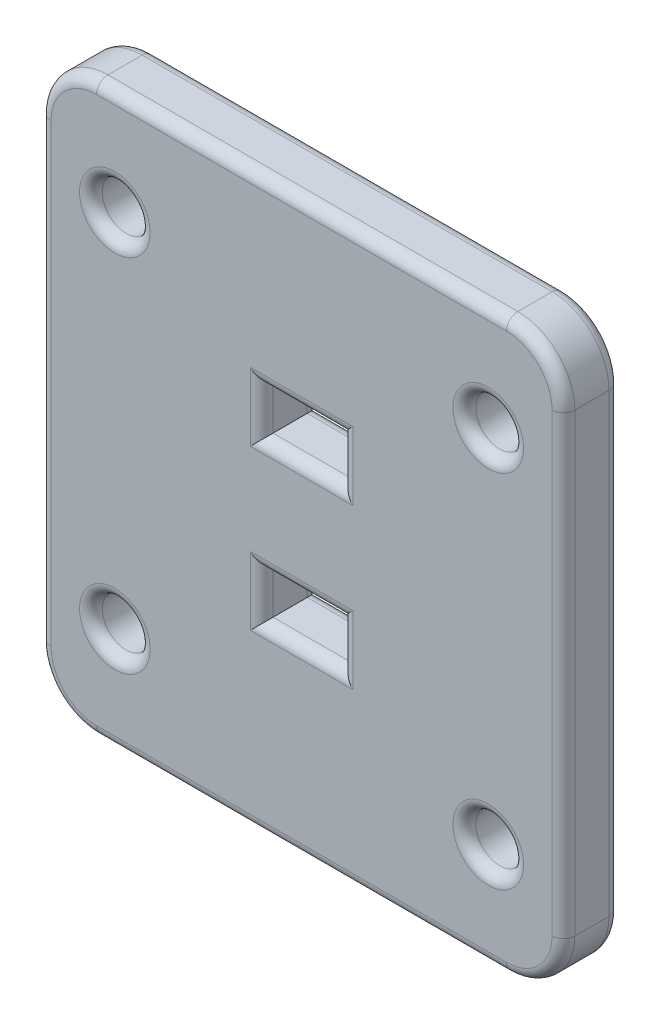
ISO-10303-21;
HEADER;
FILE_DESCRIPTION(('STEP AP214'),'2;1');
FILE_NAME('part.step','',(''),(''),'','','');
FILE_SCHEMA(('AUTOMOTIVE_DESIGN { 1 0 10303 214 1 1 1 1 }'));
ENDSEC;
DATA;
#1=APPLICATION_CONTEXT('core data for automotive mechanical design processes');
#2=APPLICATION_PROTOCOL_DEFINITION('international standard','automotive_design',2000,#1);
#3=PRODUCT_CONTEXT('',#1,'mechanical');
#4=PRODUCT('Part','Part','',(#3));
#5=PRODUCT_RELATED_PRODUCT_CATEGORY('part','',(#4));
#6=PRODUCT_DEFINITION_FORMATION('','',#4);
#7=PRODUCT_DEFINITION_CONTEXT('part definition',#1,'design');
#8=PRODUCT_DEFINITION('design','',#6,#7);
#9=PRODUCT_DEFINITION_SHAPE('','',#8);
#10=(LENGTH_UNIT() NAMED_UNIT(*) SI_UNIT(.MILLI.,.METRE.));
#11=(NAMED_UNIT(*) PLANE_ANGLE_UNIT() SI_UNIT($,.RADIAN.));
#12=(NAMED_UNIT(*) SI_UNIT($,.STERADIAN.) SOLID_ANGLE_UNIT());
#13=UNCERTAINTY_MEASURE_WITH_UNIT(LENGTH_MEASURE(1.E-05),#10,'distance_accuracy_value','');
#14=(GEOMETRIC_REPRESENTATION_CONTEXT(3) GLOBAL_UNCERTAINTY_ASSIGNED_CONTEXT((#13)) GLOBAL_UNIT_ASSIGNED_CONTEXT((#10,
#11,#12)) REPRESENTATION_CONTEXT('',''));
#15=CARTESIAN_POINT('',(0.,0.,0.));
#16=DIRECTION('',(0.,0.,1.));
#17=DIRECTION('',(1.,0.,0.));
#18=AXIS2_PLACEMENT_3D('',#15,#16,#17);
#19=CARTESIAN_POINT('',(0.,0.,25.95));
#20=DIRECTION('',(0.,0.,1.));
#21=DIRECTION('',(1.,0.,0.));
#22=AXIS2_PLACEMENT_3D('',#19,#20,#21);
#23=PLANE('',#22);
#24=CARTESIAN_POINT('',(-16.4,9.15692193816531,25.95));
#25=DIRECTION('',(0.,0.,1.));
#26=DIRECTION('',(-1.,0.,0.));
#27=AXIS2_PLACEMENT_3D('',#24,#25,#26);
#28=CIRCLE('',#27,3.1);
#29=CARTESIAN_POINT('',(-19.5,9.15692193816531,25.95));
#30=VERTEX_POINT('',#29);
#31=CARTESIAN_POINT('',(-13.3,9.15692193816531,25.95));
#32=VERTEX_POINT('',#31);
#33=EDGE_CURVE('E743',#30,#32,#28,.T.);
#34=ORIENTED_EDGE('',*,*,#33,.F.);
#35=CARTESIAN_POINT('',(-16.4,9.15692193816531,25.95));
#36=DIRECTION('',(0.,0.,1.));
#37=DIRECTION('',(1.,0.,0.));
#38=AXIS2_PLACEMENT_3D('',#35,#36,#37);
#39=CIRCLE('',#38,3.1);
#40=EDGE_CURVE('E1045',#32,#30,#39,.T.);
#41=ORIENTED_EDGE('',*,*,#40,.F.);
#42=EDGE_LOOP('',(#34,#41));
#43=FACE_BOUND('',#42,.T.);
#44=CARTESIAN_POINT('',(16.4,40.8430780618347,25.95));
#45=DIRECTION('',(0.,0.,1.));
#46=DIRECTION('',(-1.,0.,0.));
#47=AXIS2_PLACEMENT_3D('',#44,#45,#46);
#48=CIRCLE('',#47,3.1);
#49=CARTESIAN_POINT('',(13.3,40.8430780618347,25.95));
#50=VERTEX_POINT('',#49);
#51=CARTESIAN_POINT('',(19.5,40.8430780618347,25.95));
#52=VERTEX_POINT('',#51);
#53=EDGE_CURVE('E1016',#50,#52,#48,.T.);
#54=ORIENTED_EDGE('',*,*,#53,.F.);
#55=CARTESIAN_POINT('',(16.4,40.8430780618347,25.95));
#56=DIRECTION('',(0.,0.,1.));
#57=DIRECTION('',(1.,0.,0.));
#58=AXIS2_PLACEMENT_3D('',#55,#56,#57);
#59=CIRCLE('',#58,3.1);
#60=EDGE_CURVE('E692',#52,#50,#59,.T.);
#61=ORIENTED_EDGE('',*,*,#60,.F.);
#62=EDGE_LOOP('',(#54,#61));
#63=FACE_BOUND('',#62,.T.);
#64=CARTESIAN_POINT('',(16.4,9.15692193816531,25.95));
#65=DIRECTION('',(0.,0.,1.));
#66=DIRECTION('',(-1.,0.,0.));
#67=AXIS2_PLACEMENT_3D('',#64,#65,#66);
#68=CIRCLE('',#67,3.1);
#69=CARTESIAN_POINT('',(13.3,9.15692193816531,25.95));
#70=VERTEX_POINT('',#69);
#71=CARTESIAN_POINT('',(19.5,9.15692193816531,25.95));
#72=VERTEX_POINT('',#71);
#73=EDGE_CURVE('E730',#70,#72,#68,.T.);
#74=ORIENTED_EDGE('',*,*,#73,.F.);
#75=CARTESIAN_POINT('',(16.4,9.15692193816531,25.95));
#76=DIRECTION('',(0.,0.,1.));
#77=DIRECTION('',(1.,0.,0.));
#78=AXIS2_PLACEMENT_3D('',#75,#76,#77);
#79=CIRCLE('',#78,3.1);
#80=EDGE_CURVE('E1003',#72,#70,#79,.T.);
#81=ORIENTED_EDGE('',*,*,#80,.F.);
#82=EDGE_LOOP('',(#74,#81));
#83=FACE_BOUND('',#82,.T.);
#84=CARTESIAN_POINT('',(-16.4,40.8430780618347,25.95));
#85=DIRECTION('',(0.,0.,1.));
#86=DIRECTION('',(-1.,0.,0.));
#87=AXIS2_PLACEMENT_3D('',#84,#85,#86);
#88=CIRCLE('',#87,3.1);
#89=CARTESIAN_POINT('',(-19.5,40.8430780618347,25.95));
#90=VERTEX_POINT('',#89);
#91=CARTESIAN_POINT('',(-13.3,40.8430780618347,25.95));
#92=VERTEX_POINT('',#91);
#93=EDGE_CURVE('E973',#90,#92,#88,.T.);
#94=ORIENTED_EDGE('',*,*,#93,.F.);
#95=CARTESIAN_POINT('',(-16.4,40.8430780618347,25.95));
#96=DIRECTION('',(0.,0.,1.));
#97=DIRECTION('',(1.,0.,0.));
#98=AXIS2_PLACEMENT_3D('',#95,#96,#97);
#99=CIRCLE('',#98,3.1);
#100=EDGE_CURVE('E983',#92,#90,#99,.T.);
#101=ORIENTED_EDGE('',*,*,#100,.F.);
#102=EDGE_LOOP('',(#94,#101));
#103=FACE_BOUND('',#102,.T.);
#104=DIRECTION('',(-1.,0.,0.));
#105=VECTOR('',#104,1.);
#106=CARTESIAN_POINT('',(-3.5,35.,25.95));
#107=LINE('',#106,#105);
#108=CARTESIAN_POINT('',(4.5,35.,25.95));
#109=VERTEX_POINT('',#108);
#110=CARTESIAN_POINT('',(-4.5,35.,25.95));
#111=VERTEX_POINT('',#110);
#112=EDGE_CURVE('E690',#109,#111,#107,.T.);
#113=ORIENTED_EDGE('',*,*,#112,.F.);
#114=DIRECTION('',(0.,1.,0.));
#115=VECTOR('',#114,1.);
#116=CARTESIAN_POINT('',(4.5,30.,25.95));
#117=LINE('',#116,#115);
#118=CARTESIAN_POINT('',(4.5,29.,25.95));
#119=VERTEX_POINT('',#118);
#120=EDGE_CURVE('E687',#119,#109,#117,.T.);
#121=ORIENTED_EDGE('',*,*,#120,.F.);
#122=DIRECTION('',(1.,0.,0.));
#123=VECTOR('',#122,1.);
#124=CARTESIAN_POINT('',(-3.5,29.,25.95));
#125=LINE('',#124,#123);
#126=CARTESIAN_POINT('',(-4.5,29.,25.95));
#127=VERTEX_POINT('',#126);
#128=EDGE_CURVE('E681',#127,#119,#125,.T.);
#129=ORIENTED_EDGE('',*,*,#128,.F.);
#130=DIRECTION('',(0.,-1.,0.));
#131=VECTOR('',#130,1.);
#132=CARTESIAN_POINT('',(-4.5,30.,25.95));
#133=LINE('',#132,#131);
#134=EDGE_CURVE('E671',#111,#127,#133,.T.);
#135=ORIENTED_EDGE('',*,*,#134,.F.);
#136=EDGE_LOOP('',(#113,#121,#129,#135));
#137=FACE_BOUND('',#136,.T.);
#138=DIRECTION('',(-1.,0.,0.));
#139=VECTOR('',#138,1.);
#140=CARTESIAN_POINT('',(-3.5,21.,25.95));
#141=LINE('',#140,#139);
#142=CARTESIAN_POINT('',(4.5,21.,25.95));
#143=VERTEX_POINT('',#142);
#144=CARTESIAN_POINT('',(-4.5,21.,25.95));
#145=VERTEX_POINT('',#144);
#146=EDGE_CURVE('E788',#143,#145,#141,.T.);
#147=ORIENTED_EDGE('',*,*,#146,.F.);
#148=DIRECTION('',(0.,1.,0.));
#149=VECTOR('',#148,1.);
#150=CARTESIAN_POINT('',(4.5,16.,25.95));
#151=LINE('',#150,#149);
#152=CARTESIAN_POINT('',(4.5,15.,25.95));
#153=VERTEX_POINT('',#152);
#154=EDGE_CURVE('E139',#153,#143,#151,.T.);
#155=ORIENTED_EDGE('',*,*,#154,.F.);
#156=DIRECTION('',(1.,0.,0.));
#157=VECTOR('',#156,1.);
#158=CARTESIAN_POINT('',(-3.5,15.,25.95));
#159=LINE('',#158,#157);
#160=CARTESIAN_POINT('',(-4.5,15.,25.95));
#161=VERTEX_POINT('',#160);
#162=EDGE_CURVE('E780',#161,#153,#159,.T.);
#163=ORIENTED_EDGE('',*,*,#162,.F.);
#164=DIRECTION('',(0.,-1.,0.));
#165=VECTOR('',#164,1.);
#166=CARTESIAN_POINT('',(-4.5,16.,25.95));
#167=LINE('',#166,#165);
#168=EDGE_CURVE('E771',#145,#161,#167,.T.);
#169=ORIENTED_EDGE('',*,*,#168,.F.);
#170=EDGE_LOOP('',(#147,#155,#163,#169));
#171=FACE_BOUND('',#170,.T.);
#172=DIRECTION('',(0.,-1.,0.));
#173=VECTOR('',#172,1.);
#174=CARTESIAN_POINT('',(22.,0.,25.95));
#175=LINE('',#174,#173);
#176=CARTESIAN_POINT('',(22.,45.,25.95));
#177=VERTEX_POINT('',#176);
#178=CARTESIAN_POINT('',(22.,5.,25.95));
#179=VERTEX_POINT('',#178);
#180=EDGE_CURVE('E790',#177,#179,#175,.T.);
#181=ORIENTED_EDGE('',*,*,#180,.F.);
#182=CARTESIAN_POINT('',(18.,45.,25.95));
#183=DIRECTION('',(0.,0.,-1.));
#184=DIRECTION('',(0.,1.,0.));
#185=AXIS2_PLACEMENT_3D('',#182,#183,#184);
#186=CIRCLE('',#185,4.);
#187=CARTESIAN_POINT('',(18.,49.,25.95));
#188=VERTEX_POINT('',#187);
#189=EDGE_CURVE('E148',#188,#177,#186,.T.);
#190=ORIENTED_EDGE('',*,*,#189,.F.);
#191=DIRECTION('',(1.,0.,0.));
#192=VECTOR('',#191,1.);
#193=CARTESIAN_POINT('',(0.,49.,25.95));
#194=LINE('',#193,#192);
#195=CARTESIAN_POINT('',(-18.,49.,25.95));
#196=VERTEX_POINT('',#195);
#197=EDGE_CURVE('E165',#196,#188,#194,.T.);
#198=ORIENTED_EDGE('',*,*,#197,.F.);
#199=CARTESIAN_POINT('',(-18.,45.,25.95));
#200=DIRECTION('',(0.,0.,-1.));
#201=DIRECTION('',(-1.,0.,0.));
#202=AXIS2_PLACEMENT_3D('',#199,#200,#201);
#203=CIRCLE('',#202,4.);
#204=CARTESIAN_POINT('',(-22.,45.,25.95));
#205=VERTEX_POINT('',#204);
#206=EDGE_CURVE('E848',#205,#196,#203,.T.);
#207=ORIENTED_EDGE('',*,*,#206,.F.);
#208=DIRECTION('',(0.,1.,0.));
#209=VECTOR('',#208,1.);
#210=CARTESIAN_POINT('',(-22.,0.,25.95));
#211=LINE('',#210,#209);
#212=CARTESIAN_POINT('',(-22.,5.,25.95));
#213=VERTEX_POINT('',#212);
#214=EDGE_CURVE('E845',#213,#205,#211,.T.);
#215=ORIENTED_EDGE('',*,*,#214,.F.);
#216=CARTESIAN_POINT('',(-18.,5.,25.95));
#217=DIRECTION('',(0.,0.,-1.));
#218=DIRECTION('',(0.,-1.,0.));
#219=AXIS2_PLACEMENT_3D('',#216,#217,#218);
#220=CIRCLE('',#219,4.);
#221=CARTESIAN_POINT('',(-18.,1.,25.95));
#222=VERTEX_POINT('',#221);
#223=EDGE_CURVE('E855',#222,#213,#220,.T.);
#224=ORIENTED_EDGE('',*,*,#223,.F.);
#225=DIRECTION('',(-1.,0.,0.));
#226=VECTOR('',#225,1.);
#227=CARTESIAN_POINT('',(0.,1.,25.95));
#228=LINE('',#227,#226);
#229=CARTESIAN_POINT('',(18.,1.,25.95));
#230=VERTEX_POINT('',#229);
#231=EDGE_CURVE('E834',#230,#222,#228,.T.);
#232=ORIENTED_EDGE('',*,*,#231,.F.);
#233=CARTESIAN_POINT('',(18.,5.,25.95));
#234=DIRECTION('',(0.,0.,-1.));
#235=DIRECTION('',(1.,0.,0.));
#236=AXIS2_PLACEMENT_3D('',#233,#234,#235);
#237=CIRCLE('',#236,4.);
#238=EDGE_CURVE('E806',#179,#230,#237,.T.);
#239=ORIENTED_EDGE('',*,*,#238,.F.);
#240=EDGE_LOOP('',(#181,#190,#198,#207,#215,#224,#232,#239));
#241=FACE_BOUND('',#240,.T.);
#242=ADVANCED_FACE('F17',(#43,#63,#83,#103,#137,#171,#241),#23,.T.);
#243=CARTESIAN_POINT('',(18.,45.,24.95));
#244=DIRECTION('',(0.,0.,1.));
#245=DIRECTION('',(1.,0.,0.));
#246=AXIS2_PLACEMENT_3D('',#243,#244,#245);
#247=TOROIDAL_SURFACE('',#246,4.,1.);
#248=CARTESIAN_POINT('',(18.,49.,24.95));
#249=DIRECTION('',(1.,0.,0.));
#250=DIRECTION('',(0.,0.,-1.));
#251=AXIS2_PLACEMENT_3D('',#248,#249,#250);
#252=CIRCLE('',#251,1.);
#253=CARTESIAN_POINT('',(18.,50.,24.95));
#254=VERTEX_POINT('',#253);
#255=EDGE_CURVE('E911',#188,#254,#252,.F.);
#256=ORIENTED_EDGE('',*,*,#255,.F.);
#257=ORIENTED_EDGE('',*,*,#189,.T.);
#258=CARTESIAN_POINT('',(22.,45.,24.95));
#259=DIRECTION('',(0.,-1.,0.));
#260=DIRECTION('',(0.,0.,-1.));
#261=AXIS2_PLACEMENT_3D('',#258,#259,#260);
#262=CIRCLE('',#261,1.);
#263=CARTESIAN_POINT('',(23.,45.,24.95));
#264=VERTEX_POINT('',#263);
#265=EDGE_CURVE('E805',#264,#177,#262,.T.);
#266=ORIENTED_EDGE('',*,*,#265,.F.);
#267=CARTESIAN_POINT('',(18.,45.,24.95));
#268=DIRECTION('',(0.,0.,-1.));
#269=DIRECTION('',(-1.,0.,0.));
#270=AXIS2_PLACEMENT_3D('',#267,#268,#269);
#271=CIRCLE('',#270,5.);
#272=EDGE_CURVE('E799',#254,#264,#271,.T.);
#273=ORIENTED_EDGE('',*,*,#272,.F.);
#274=EDGE_LOOP('',(#256,#257,#266,#273));
#275=FACE_BOUND('',#274,.T.);
#276=ADVANCED_FACE('F918',(#275),#247,.T.);
#277=CARTESIAN_POINT('',(0.,49.,24.95));
#278=DIRECTION('',(1.,0.,0.));
#279=DIRECTION('',(0.,0.,-1.));
#280=AXIS2_PLACEMENT_3D('',#277,#278,#279);
#281=CYLINDRICAL_SURFACE('',#280,1.);
#282=CARTESIAN_POINT('',(-18.,49.,24.95));
#283=DIRECTION('',(-1.,0.,0.));
#284=DIRECTION('',(0.,1.,0.));
#285=AXIS2_PLACEMENT_3D('',#282,#283,#284);
#286=CIRCLE('',#285,1.);
#287=CARTESIAN_POINT('',(-18.,50.,24.95));
#288=VERTEX_POINT('',#287);
#289=EDGE_CURVE('E894',#196,#288,#286,.T.);
#290=ORIENTED_EDGE('',*,*,#289,.F.);
#291=ORIENTED_EDGE('',*,*,#197,.T.);
#292=ORIENTED_EDGE('',*,*,#255,.T.);
#293=DIRECTION('',(1.,0.,0.));
#294=VECTOR('',#293,1.);
#295=CARTESIAN_POINT('',(-23.,50.,24.95));
#296=LINE('',#295,#294);
#297=EDGE_CURVE('E668',#254,#288,#296,.F.);
#298=ORIENTED_EDGE('',*,*,#297,.T.);
#299=EDGE_LOOP('',(#290,#291,#292,#298));
#300=FACE_BOUND('',#299,.T.);
#301=ADVANCED_FACE('F900',(#300),#281,.T.);
#302=CARTESIAN_POINT('',(-18.,45.,24.95));
#303=DIRECTION('',(0.,0.,1.));
#304=DIRECTION('',(1.,0.,0.));
#305=AXIS2_PLACEMENT_3D('',#302,#303,#304);
#306=TOROIDAL_SURFACE('',#305,4.,1.);
#307=CARTESIAN_POINT('',(-22.,45.,24.95));
#308=DIRECTION('',(0.,1.,0.));
#309=DIRECTION('',(0.,0.,1.));
#310=AXIS2_PLACEMENT_3D('',#307,#308,#309);
#311=CIRCLE('',#310,1.);
#312=CARTESIAN_POINT('',(-23.,45.,24.95));
#313=VERTEX_POINT('',#312);
#314=EDGE_CURVE('E847',#205,#313,#311,.F.);
#315=ORIENTED_EDGE('',*,*,#314,.F.);
#316=ORIENTED_EDGE('',*,*,#206,.T.);
#317=ORIENTED_EDGE('',*,*,#289,.T.);
#318=CARTESIAN_POINT('',(-18.,45.,24.95));
#319=DIRECTION('',(0.,0.,-1.));
#320=DIRECTION('',(-1.,0.,0.));
#321=AXIS2_PLACEMENT_3D('',#318,#319,#320);
#322=CIRCLE('',#321,5.);
#323=EDGE_CURVE('E662',#313,#288,#322,.T.);
#324=ORIENTED_EDGE('',*,*,#323,.F.);
#325=EDGE_LOOP('',(#315,#316,#317,#324));
#326=FACE_BOUND('',#325,.T.);
#327=ADVANCED_FACE('F896',(#326),#306,.T.);
#328=CARTESIAN_POINT('',(-22.,0.,24.95));
#329=DIRECTION('',(0.,1.,0.));
#330=DIRECTION('',(0.,0.,1.));
#331=AXIS2_PLACEMENT_3D('',#328,#329,#330);
#332=CYLINDRICAL_SURFACE('',#331,1.);
#333=ORIENTED_EDGE('',*,*,#314,.T.);
#334=DIRECTION('',(0.,1.,0.));
#335=VECTOR('',#334,1.);
#336=CARTESIAN_POINT('',(-23.,50.,24.95));
#337=LINE('',#336,#335);
#338=CARTESIAN_POINT('',(-23.,5.,24.95));
#339=VERTEX_POINT('',#338);
#340=EDGE_CURVE('E649',#313,#339,#337,.F.);
#341=ORIENTED_EDGE('',*,*,#340,.T.);
#342=CARTESIAN_POINT('',(-22.,5.,24.95));
#343=DIRECTION('',(0.,-1.,0.));
#344=DIRECTION('',(-1.,0.,0.));
#345=AXIS2_PLACEMENT_3D('',#342,#343,#344);
#346=CIRCLE('',#345,1.);
#347=EDGE_CURVE('E842',#213,#339,#346,.T.);
#348=ORIENTED_EDGE('',*,*,#347,.F.);
#349=ORIENTED_EDGE('',*,*,#214,.T.);
#350=EDGE_LOOP('',(#333,#341,#348,#349));
#351=FACE_BOUND('',#350,.T.);
#352=ADVANCED_FACE('F871',(#351),#332,.T.);
#353=CARTESIAN_POINT('',(-18.,5.,24.95));
#354=DIRECTION('',(0.,0.,1.));
#355=DIRECTION('',(1.,0.,0.));
#356=AXIS2_PLACEMENT_3D('',#353,#354,#355);
#357=TOROIDAL_SURFACE('',#356,4.,1.);
#358=ORIENTED_EDGE('',*,*,#347,.T.);
#359=CARTESIAN_POINT('',(-18.,5.,24.95));
#360=DIRECTION('',(0.,0.,-1.));
#361=DIRECTION('',(-1.,0.,0.));
#362=AXIS2_PLACEMENT_3D('',#359,#360,#361);
#363=CIRCLE('',#362,5.);
#364=CARTESIAN_POINT('',(-18.,0.,24.95));
#365=VERTEX_POINT('',#364);
#366=EDGE_CURVE('E639',#365,#339,#363,.T.);
#367=ORIENTED_EDGE('',*,*,#366,.F.);
#368=CARTESIAN_POINT('',(-18.,1.,24.95));
#369=DIRECTION('',(-1.,0.,0.));
#370=DIRECTION('',(0.,0.,1.));
#371=AXIS2_PLACEMENT_3D('',#368,#369,#370);
#372=CIRCLE('',#371,1.);
#373=EDGE_CURVE('E841',#222,#365,#372,.F.);
#374=ORIENTED_EDGE('',*,*,#373,.F.);
#375=ORIENTED_EDGE('',*,*,#223,.T.);
#376=EDGE_LOOP('',(#358,#367,#374,#375));
#377=FACE_BOUND('',#376,.T.);
#378=ADVANCED_FACE('F861',(#377),#357,.T.);
#379=CARTESIAN_POINT('',(0.,1.,24.95));
#380=DIRECTION('',(-1.,0.,0.));
#381=DIRECTION('',(0.,0.,1.));
#382=AXIS2_PLACEMENT_3D('',#379,#380,#381);
#383=CYLINDRICAL_SURFACE('',#382,1.);
#384=ORIENTED_EDGE('',*,*,#373,.T.);
#385=DIRECTION('',(1.,0.,0.));
#386=VECTOR('',#385,1.);
#387=CARTESIAN_POINT('',(-23.,0.,24.95));
#388=LINE('',#387,#386);
#389=CARTESIAN_POINT('',(18.,0.,24.95));
#390=VERTEX_POINT('',#389);
#391=EDGE_CURVE('E630',#365,#390,#388,.T.);
#392=ORIENTED_EDGE('',*,*,#391,.T.);
#393=CARTESIAN_POINT('',(18.,1.,24.95));
#394=DIRECTION('',(1.,0.,0.));
#395=DIRECTION('',(0.,-1.,0.));
#396=AXIS2_PLACEMENT_3D('',#393,#394,#395);
#397=CIRCLE('',#396,1.);
#398=EDGE_CURVE('E814',#230,#390,#397,.T.);
#399=ORIENTED_EDGE('',*,*,#398,.F.);
#400=ORIENTED_EDGE('',*,*,#231,.T.);
#401=EDGE_LOOP('',(#384,#392,#399,#400));
#402=FACE_BOUND('',#401,.T.);
#403=ADVANCED_FACE('F823',(#402),#383,.T.);
#404=CARTESIAN_POINT('',(18.,5.,24.95));
#405=DIRECTION('',(0.,0.,1.));
#406=DIRECTION('',(1.,0.,0.));
#407=AXIS2_PLACEMENT_3D('',#404,#405,#406);
#408=TOROIDAL_SURFACE('',#407,4.,1.);
#409=CARTESIAN_POINT('',(22.,5.,24.95));
#410=DIRECTION('',(0.,-1.,0.));
#411=DIRECTION('',(0.,0.,-1.));
#412=AXIS2_PLACEMENT_3D('',#409,#410,#411);
#413=CIRCLE('',#412,1.);
#414=CARTESIAN_POINT('',(23.,5.,24.95));
#415=VERTEX_POINT('',#414);
#416=EDGE_CURVE('E803',#179,#415,#413,.F.);
#417=ORIENTED_EDGE('',*,*,#416,.F.);
#418=ORIENTED_EDGE('',*,*,#238,.T.);
#419=ORIENTED_EDGE('',*,*,#398,.T.);
#420=CARTESIAN_POINT('',(18.,5.,24.95));
#421=DIRECTION('',(0.,0.,-1.));
#422=DIRECTION('',(-1.,0.,0.));
#423=AXIS2_PLACEMENT_3D('',#420,#421,#422);
#424=CIRCLE('',#423,5.);
#425=EDGE_CURVE('E624',#415,#390,#424,.T.);
#426=ORIENTED_EDGE('',*,*,#425,.F.);
#427=EDGE_LOOP('',(#417,#418,#419,#426));
#428=FACE_BOUND('',#427,.T.);
#429=ADVANCED_FACE('F817',(#428),#408,.T.);
#430=CARTESIAN_POINT('',(22.,0.,24.95));
#431=DIRECTION('',(0.,-1.,0.));
#432=DIRECTION('',(0.,0.,-1.));
#433=AXIS2_PLACEMENT_3D('',#430,#431,#432);
#434=CYLINDRICAL_SURFACE('',#433,1.);
#435=ORIENTED_EDGE('',*,*,#265,.T.);
#436=ORIENTED_EDGE('',*,*,#180,.T.);
#437=ORIENTED_EDGE('',*,*,#416,.T.);
#438=DIRECTION('',(0.,1.,0.));
#439=VECTOR('',#438,1.);
#440=CARTESIAN_POINT('',(23.,50.,24.95));
#441=LINE('',#440,#439);
#442=EDGE_CURVE('E611',#415,#264,#441,.T.);
#443=ORIENTED_EDGE('',*,*,#442,.T.);
#444=EDGE_LOOP('',(#435,#436,#437,#443));
#445=FACE_BOUND('',#444,.T.);
#446=ADVANCED_FACE('F822',(#445),#434,.T.);
#447=CARTESIAN_POINT('',(-3.5,21.,24.95));
#448=DIRECTION('',(-1.,0.,0.));
#449=DIRECTION('',(0.,0.,1.));
#450=AXIS2_PLACEMENT_3D('',#447,#448,#449);
#451=CYLINDRICAL_SURFACE('',#450,1.);
#452=CARTESIAN_POINT('',(-4.5,21.,24.95));
#453=DIRECTION('',(-0.707106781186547,-0.707106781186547,0.));
#454=DIRECTION('',(-0.707106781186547,0.707106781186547,0.));
#455=AXIS2_PLACEMENT_3D('',#452,#453,#454);
#456=ELLIPSE('',#455,1.4142135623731,1.);
#457=CARTESIAN_POINT('',(-3.5,20.,24.95));
#458=VERTEX_POINT('',#457);
#459=EDGE_CURVE('E774',#458,#145,#456,.T.);
#460=ORIENTED_EDGE('',*,*,#459,.F.);
#461=DIRECTION('',(1.,0.,0.));
#462=VECTOR('',#461,1.);
#463=CARTESIAN_POINT('',(-3.5,20.,24.95));
#464=LINE('',#463,#462);
#465=CARTESIAN_POINT('',(3.5,20.,24.95));
#466=VERTEX_POINT('',#465);
#467=EDGE_CURVE('E594',#466,#458,#464,.F.);
#468=ORIENTED_EDGE('',*,*,#467,.F.);
#469=CARTESIAN_POINT('',(4.5,21.,24.95));
#470=DIRECTION('',(-0.707106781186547,0.707106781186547,0.));
#471=DIRECTION('',(-0.707106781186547,-0.707106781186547,0.));
#472=AXIS2_PLACEMENT_3D('',#469,#470,#471);
#473=ELLIPSE('',#472,1.4142135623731,1.);
#474=EDGE_CURVE('E787',#143,#466,#473,.F.);
#475=ORIENTED_EDGE('',*,*,#474,.F.);
#476=ORIENTED_EDGE('',*,*,#146,.T.);
#477=EDGE_LOOP('',(#460,#468,#475,#476));
#478=FACE_BOUND('',#477,.T.);
#479=ADVANCED_FACE('F1073',(#478),#451,.T.);
#480=CARTESIAN_POINT('',(4.5,16.,24.95));
#481=DIRECTION('',(0.,1.,0.));
#482=DIRECTION('',(0.,0.,1.));
#483=AXIS2_PLACEMENT_3D('',#480,#481,#482);
#484=CYLINDRICAL_SURFACE('',#483,1.);
#485=ORIENTED_EDGE('',*,*,#474,.T.);
#486=DIRECTION('',(0.,1.,0.));
#487=VECTOR('',#486,1.);
#488=CARTESIAN_POINT('',(3.5,16.,24.95));
#489=LINE('',#488,#487);
#490=CARTESIAN_POINT('',(3.5,16.,24.95));
#491=VERTEX_POINT('',#490);
#492=EDGE_CURVE('E591',#491,#466,#489,.T.);
#493=ORIENTED_EDGE('',*,*,#492,.F.);
#494=CARTESIAN_POINT('',(4.5,15.,24.95));
#495=DIRECTION('',(0.707106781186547,0.707106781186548,0.));
#496=DIRECTION('',(-0.707106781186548,0.707106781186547,0.));
#497=AXIS2_PLACEMENT_3D('',#494,#495,#496);
#498=ELLIPSE('',#497,1.4142135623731,1.);
#499=EDGE_CURVE('E783',#153,#491,#498,.F.);
#500=ORIENTED_EDGE('',*,*,#499,.F.);
#501=ORIENTED_EDGE('',*,*,#154,.T.);
#502=EDGE_LOOP('',(#485,#493,#500,#501));
#503=FACE_BOUND('',#502,.T.);
#504=ADVANCED_FACE('F1070',(#503),#484,.T.);
#505=CARTESIAN_POINT('',(-3.5,15.,24.95));
#506=DIRECTION('',(1.,0.,0.));
#507=DIRECTION('',(0.,1.,0.));
#508=AXIS2_PLACEMENT_3D('',#505,#506,#507);
#509=CYLINDRICAL_SURFACE('',#508,1.);
#510=CARTESIAN_POINT('',(-4.5,15.,24.95));
#511=DIRECTION('',(0.707106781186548,-0.707106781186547,0.));
#512=DIRECTION('',(-0.707106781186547,-0.707106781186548,0.));
#513=AXIS2_PLACEMENT_3D('',#510,#511,#512);
#514=ELLIPSE('',#513,1.4142135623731,1.);
#515=CARTESIAN_POINT('',(-3.5,16.,24.95));
#516=VERTEX_POINT('',#515);
#517=EDGE_CURVE('E773',#161,#516,#514,.F.);
#518=ORIENTED_EDGE('',*,*,#517,.F.);
#519=ORIENTED_EDGE('',*,*,#162,.T.);
#520=ORIENTED_EDGE('',*,*,#499,.T.);
#521=DIRECTION('',(1.,0.,0.));
#522=VECTOR('',#521,1.);
#523=CARTESIAN_POINT('',(-3.5,16.,24.95));
#524=LINE('',#523,#522);
#525=EDGE_CURVE('E588',#516,#491,#524,.T.);
#526=ORIENTED_EDGE('',*,*,#525,.F.);
#527=EDGE_LOOP('',(#518,#519,#520,#526));
#528=FACE_BOUND('',#527,.T.);
#529=ADVANCED_FACE('F1155',(#528),#509,.T.);
#530=CARTESIAN_POINT('',(-4.5,16.,24.95));
#531=DIRECTION('',(0.,-1.,0.));
#532=DIRECTION('',(0.,0.,-1.));
#533=AXIS2_PLACEMENT_3D('',#530,#531,#532);
#534=CYLINDRICAL_SURFACE('',#533,1.);
#535=ORIENTED_EDGE('',*,*,#517,.T.);
#536=DIRECTION('',(0.,1.,0.));
#537=VECTOR('',#536,1.);
#538=CARTESIAN_POINT('',(-3.5,16.,24.95));
#539=LINE('',#538,#537);
#540=EDGE_CURVE('E585',#458,#516,#539,.F.);
#541=ORIENTED_EDGE('',*,*,#540,.F.);
#542=ORIENTED_EDGE('',*,*,#459,.T.);
#543=ORIENTED_EDGE('',*,*,#168,.T.);
#544=EDGE_LOOP('',(#535,#541,#542,#543));
#545=FACE_BOUND('',#544,.T.);
#546=ADVANCED_FACE('F1157',(#545),#534,.T.);
#547=CARTESIAN_POINT('',(-16.4,40.8430780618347,24.95));
#548=DIRECTION('',(0.,0.,1.));
#549=DIRECTION('',(1.,0.,0.));
#550=AXIS2_PLACEMENT_3D('',#547,#548,#549);
#551=TOROIDAL_SURFACE('',#550,3.1,1.);
#552=CARTESIAN_POINT('',(-16.4,40.8430780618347,24.95));
#553=DIRECTION('',(0.,0.,-1.));
#554=DIRECTION('',(-1.,0.,0.));
#555=AXIS2_PLACEMENT_3D('',#552,#553,#554);
#556=CIRCLE('',#555,2.1);
#557=CARTESIAN_POINT('',(-18.5,40.8430780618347,24.95));
#558=VERTEX_POINT('',#557);
#559=EDGE_CURVE('E767',#558,#558,#556,.T.);
#560=ORIENTED_EDGE('',*,*,#559,.T.);
#561=EDGE_LOOP('',(#560));
#562=FACE_BOUND('',#561,.T.);
#563=ORIENTED_EDGE('',*,*,#100,.T.);
#564=ORIENTED_EDGE('',*,*,#93,.T.);
#565=EDGE_LOOP('',(#563,#564));
#566=FACE_BOUND('',#565,.T.);
#567=ADVANCED_FACE('F756',(#562,#566),#551,.T.);
#568=CARTESIAN_POINT('',(-16.4,9.15692193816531,24.95));
#569=DIRECTION('',(0.,0.,1.));
#570=DIRECTION('',(1.,0.,0.));
#571=AXIS2_PLACEMENT_3D('',#568,#569,#570);
#572=TOROIDAL_SURFACE('',#571,3.1,1.);
#573=CARTESIAN_POINT('',(-16.4,9.15692193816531,24.95));
#574=DIRECTION('',(0.,0.,-1.));
#575=DIRECTION('',(-1.,0.,0.));
#576=AXIS2_PLACEMENT_3D('',#573,#574,#575);
#577=CIRCLE('',#576,2.1);
#578=CARTESIAN_POINT('',(-18.5,9.15692193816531,24.95));
#579=VERTEX_POINT('',#578);
#580=EDGE_CURVE('E766',#579,#579,#577,.T.);
#581=ORIENTED_EDGE('',*,*,#580,.T.);
#582=EDGE_LOOP('',(#581));
#583=FACE_BOUND('',#582,.T.);
#584=ORIENTED_EDGE('',*,*,#40,.T.);
#585=ORIENTED_EDGE('',*,*,#33,.T.);
#586=EDGE_LOOP('',(#584,#585));
#587=FACE_BOUND('',#586,.T.);
#588=ADVANCED_FACE('F747',(#583,#587),#572,.T.);
#589=CARTESIAN_POINT('',(16.4,9.15692193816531,24.95));
#590=DIRECTION('',(0.,0.,1.));
#591=DIRECTION('',(1.,0.,0.));
#592=AXIS2_PLACEMENT_3D('',#589,#590,#591);
#593=TOROIDAL_SURFACE('',#592,3.1,1.);
#594=CARTESIAN_POINT('',(16.4,9.15692193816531,24.95));
#595=DIRECTION('',(0.,0.,-1.));
#596=DIRECTION('',(-1.,0.,0.));
#597=AXIS2_PLACEMENT_3D('',#594,#595,#596);
#598=CIRCLE('',#597,2.1);
#599=CARTESIAN_POINT('',(14.3,9.15692193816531,24.95));
#600=VERTEX_POINT('',#599);
#601=EDGE_CURVE('E695',#600,#600,#598,.T.);
#602=ORIENTED_EDGE('',*,*,#601,.T.);
#603=EDGE_LOOP('',(#602));
#604=FACE_BOUND('',#603,.T.);
#605=ORIENTED_EDGE('',*,*,#80,.T.);
#606=ORIENTED_EDGE('',*,*,#73,.T.);
#607=EDGE_LOOP('',(#605,#606));
#608=FACE_BOUND('',#607,.T.);
#609=ADVANCED_FACE('F706',(#604,#608),#593,.T.);
#610=CARTESIAN_POINT('',(16.4,40.8430780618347,24.95));
#611=DIRECTION('',(0.,0.,1.));
#612=DIRECTION('',(1.,0.,0.));
#613=AXIS2_PLACEMENT_3D('',#610,#611,#612);
#614=TOROIDAL_SURFACE('',#613,3.1,1.);
#615=CARTESIAN_POINT('',(16.4,40.8430780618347,24.95));
#616=DIRECTION('',(0.,0.,-1.));
#617=DIRECTION('',(-1.,0.,0.));
#618=AXIS2_PLACEMENT_3D('',#615,#616,#617);
#619=CIRCLE('',#618,2.1);
#620=CARTESIAN_POINT('',(14.3,40.8430780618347,24.95));
#621=VERTEX_POINT('',#620);
#622=EDGE_CURVE('E678',#621,#621,#619,.T.);
#623=ORIENTED_EDGE('',*,*,#622,.T.);
#624=EDGE_LOOP('',(#623));
#625=FACE_BOUND('',#624,.T.);
#626=ORIENTED_EDGE('',*,*,#60,.T.);
#627=ORIENTED_EDGE('',*,*,#53,.T.);
#628=EDGE_LOOP('',(#626,#627));
#629=FACE_BOUND('',#628,.T.);
#630=ADVANCED_FACE('F700',(#625,#629),#614,.T.);
#631=CARTESIAN_POINT('',(-3.5,35.,24.95));
#632=DIRECTION('',(-1.,0.,0.));
#633=DIRECTION('',(0.,0.,1.));
#634=AXIS2_PLACEMENT_3D('',#631,#632,#633);
#635=CYLINDRICAL_SURFACE('',#634,1.);
#636=CARTESIAN_POINT('',(-4.5,35.,24.95));
#637=DIRECTION('',(-0.707106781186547,-0.707106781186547,0.));
#638=DIRECTION('',(-0.707106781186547,0.707106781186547,0.));
#639=AXIS2_PLACEMENT_3D('',#636,#637,#638);
#640=ELLIPSE('',#639,1.4142135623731,1.);
#641=CARTESIAN_POINT('',(-3.5,34.,24.95));
#642=VERTEX_POINT('',#641);
#643=EDGE_CURVE('E674',#642,#111,#640,.T.);
#644=ORIENTED_EDGE('',*,*,#643,.F.);
#645=DIRECTION('',(1.,0.,0.));
#646=VECTOR('',#645,1.);
#647=CARTESIAN_POINT('',(-3.5,34.,24.95));
#648=LINE('',#647,#646);
#649=CARTESIAN_POINT('',(3.5,34.,24.95));
#650=VERTEX_POINT('',#649);
#651=EDGE_CURVE('E568',#650,#642,#648,.F.);
#652=ORIENTED_EDGE('',*,*,#651,.F.);
#653=CARTESIAN_POINT('',(4.5,35.,24.95));
#654=DIRECTION('',(-0.707106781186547,0.707106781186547,0.));
#655=DIRECTION('',(-0.707106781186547,-0.707106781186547,0.));
#656=AXIS2_PLACEMENT_3D('',#653,#654,#655);
#657=ELLIPSE('',#656,1.4142135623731,1.);
#658=EDGE_CURVE('E689',#109,#650,#657,.F.);
#659=ORIENTED_EDGE('',*,*,#658,.F.);
#660=ORIENTED_EDGE('',*,*,#112,.T.);
#661=EDGE_LOOP('',(#644,#652,#659,#660));
#662=FACE_BOUND('',#661,.T.);
#663=ADVANCED_FACE('F705',(#662),#635,.T.);
#664=CARTESIAN_POINT('',(4.5,30.,24.95));
#665=DIRECTION('',(0.,1.,0.));
#666=DIRECTION('',(0.,0.,1.));
#667=AXIS2_PLACEMENT_3D('',#664,#665,#666);
#668=CYLINDRICAL_SURFACE('',#667,1.);
#669=ORIENTED_EDGE('',*,*,#658,.T.);
#670=DIRECTION('',(0.,1.,0.));
#671=VECTOR('',#670,1.);
#672=CARTESIAN_POINT('',(3.5,30.,24.95));
#673=LINE('',#672,#671);
#674=CARTESIAN_POINT('',(3.5,30.,24.95));
#675=VERTEX_POINT('',#674);
#676=EDGE_CURVE('E565',#675,#650,#673,.T.);
#677=ORIENTED_EDGE('',*,*,#676,.F.);
#678=CARTESIAN_POINT('',(4.5,29.,24.95));
#679=DIRECTION('',(0.707106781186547,0.707106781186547,0.));
#680=DIRECTION('',(-0.707106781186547,0.707106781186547,0.));
#681=AXIS2_PLACEMENT_3D('',#678,#679,#680);
#682=ELLIPSE('',#681,1.4142135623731,1.);
#683=EDGE_CURVE('E684',#119,#675,#682,.F.);
#684=ORIENTED_EDGE('',*,*,#683,.F.);
#685=ORIENTED_EDGE('',*,*,#120,.T.);
#686=EDGE_LOOP('',(#669,#677,#684,#685));
#687=FACE_BOUND('',#686,.T.);
#688=ADVANCED_FACE('F1106',(#687),#668,.T.);
#689=CARTESIAN_POINT('',(-3.5,29.,24.95));
#690=DIRECTION('',(1.,0.,0.));
#691=DIRECTION('',(0.,0.,-1.));
#692=AXIS2_PLACEMENT_3D('',#689,#690,#691);
#693=CYLINDRICAL_SURFACE('',#692,1.);
#694=CARTESIAN_POINT('',(-4.5,29.,24.95));
#695=DIRECTION('',(0.707106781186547,-0.707106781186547,0.));
#696=DIRECTION('',(0.707106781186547,0.707106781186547,0.));
#697=AXIS2_PLACEMENT_3D('',#694,#695,#696);
#698=ELLIPSE('',#697,1.4142135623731,1.);
#699=CARTESIAN_POINT('',(-3.5,30.,24.95));
#700=VERTEX_POINT('',#699);
#701=EDGE_CURVE('E673',#127,#700,#698,.F.);
#702=ORIENTED_EDGE('',*,*,#701,.F.);
#703=ORIENTED_EDGE('',*,*,#128,.T.);
#704=ORIENTED_EDGE('',*,*,#683,.T.);
#705=DIRECTION('',(1.,0.,0.));
#706=VECTOR('',#705,1.);
#707=CARTESIAN_POINT('',(-3.5,30.,24.95));
#708=LINE('',#707,#706);
#709=EDGE_CURVE('E562',#700,#675,#708,.T.);
#710=ORIENTED_EDGE('',*,*,#709,.F.);
#711=EDGE_LOOP('',(#702,#703,#704,#710));
#712=FACE_BOUND('',#711,.T.);
#713=ADVANCED_FACE('F1354',(#712),#693,.T.);
#714=CARTESIAN_POINT('',(-4.5,30.,24.95));
#715=DIRECTION('',(0.,-1.,0.));
#716=DIRECTION('',(0.,0.,-1.));
#717=AXIS2_PLACEMENT_3D('',#714,#715,#716);
#718=CYLINDRICAL_SURFACE('',#717,1.);
#719=ORIENTED_EDGE('',*,*,#701,.T.);
#720=DIRECTION('',(0.,1.,0.));
#721=VECTOR('',#720,1.);
#722=CARTESIAN_POINT('',(-3.5,30.,24.95));
#723=LINE('',#722,#721);
#724=EDGE_CURVE('E558',#642,#700,#723,.F.);
#725=ORIENTED_EDGE('',*,*,#724,.F.);
#726=ORIENTED_EDGE('',*,*,#643,.T.);
#727=ORIENTED_EDGE('',*,*,#134,.T.);
#728=EDGE_LOOP('',(#719,#725,#726,#727));
#729=FACE_BOUND('',#728,.T.);
#730=ADVANCED_FACE('F1356',(#729),#718,.T.);
#731=CARTESIAN_POINT('',(18.,45.,25.95));
#732=DIRECTION('',(0.,0.,-1.));
#733=DIRECTION('',(-1.,0.,0.));
#734=AXIS2_PLACEMENT_3D('',#731,#732,#733);
#735=CYLINDRICAL_SURFACE('',#734,5.);
#736=DIRECTION('',(0.,0.,-1.));
#737=VECTOR('',#736,1.);
#738=CARTESIAN_POINT('',(18.,50.,25.95));
#739=LINE('',#738,#737);
#740=CARTESIAN_POINT('',(18.,50.,21.95));
#741=VERTEX_POINT('',#740);
#742=EDGE_CURVE('E663',#741,#254,#739,.F.);
#743=ORIENTED_EDGE('',*,*,#742,.T.);
#744=ORIENTED_EDGE('',*,*,#272,.T.);
#745=DIRECTION('',(0.,0.,1.));
#746=VECTOR('',#745,1.);
#747=CARTESIAN_POINT('',(23.,45.,25.95));
#748=LINE('',#747,#746);
#749=CARTESIAN_POINT('',(23.,45.,21.95));
#750=VERTEX_POINT('',#749);
#751=EDGE_CURVE('E606',#264,#750,#748,.F.);
#752=ORIENTED_EDGE('',*,*,#751,.T.);
#753=CARTESIAN_POINT('',(18.,45.,21.95));
#754=DIRECTION('',(0.,0.,1.));
#755=DIRECTION('',(1.,0.,0.));
#756=AXIS2_PLACEMENT_3D('',#753,#754,#755);
#757=CIRCLE('',#756,5.);
#758=EDGE_CURVE('E614',#741,#750,#757,.F.);
#759=ORIENTED_EDGE('',*,*,#758,.F.);
#760=EDGE_LOOP('',(#743,#744,#752,#759));
#761=FACE_BOUND('',#760,.T.);
#762=ADVANCED_FACE('F1208',(#761),#735,.T.);
#763=CARTESIAN_POINT('',(-23.,50.,25.95));
#764=DIRECTION('',(0.,-1.,0.));
#765=DIRECTION('',(0.,0.,-1.));
#766=AXIS2_PLACEMENT_3D('',#763,#764,#765);
#767=PLANE('',#766);
#768=DIRECTION('',(-1.,0.,0.));
#769=VECTOR('',#768,1.);
#770=CARTESIAN_POINT('',(-23.,50.,21.95));
#771=LINE('',#770,#769);
#772=CARTESIAN_POINT('',(-18.,50.,21.95));
#773=VERTEX_POINT('',#772);
#774=EDGE_CURVE('E533',#773,#741,#771,.F.);
#775=ORIENTED_EDGE('',*,*,#774,.F.);
#776=DIRECTION('',(0.,0.,-1.));
#777=VECTOR('',#776,1.);
#778=CARTESIAN_POINT('',(-18.,50.,25.95));
#779=LINE('',#778,#777);
#780=EDGE_CURVE('E660',#288,#773,#779,.T.);
#781=ORIENTED_EDGE('',*,*,#780,.F.);
#782=ORIENTED_EDGE('',*,*,#297,.F.);
#783=ORIENTED_EDGE('',*,*,#742,.F.);
#784=EDGE_LOOP('',(#775,#781,#782,#783));
#785=FACE_BOUND('',#784,.T.);
#786=ADVANCED_FACE('F1227',(#785),#767,.F.);
#787=CARTESIAN_POINT('',(-18.,45.,25.95));
#788=DIRECTION('',(0.,0.,-1.));
#789=DIRECTION('',(-1.,0.,0.));
#790=AXIS2_PLACEMENT_3D('',#787,#788,#789);
#791=CYLINDRICAL_SURFACE('',#790,5.);
#792=DIRECTION('',(0.,0.,-1.));
#793=VECTOR('',#792,1.);
#794=CARTESIAN_POINT('',(-23.,45.,25.95));
#795=LINE('',#794,#793);
#796=CARTESIAN_POINT('',(-23.,45.,21.95));
#797=VERTEX_POINT('',#796);
#798=EDGE_CURVE('E640',#797,#313,#795,.F.);
#799=ORIENTED_EDGE('',*,*,#798,.T.);
#800=ORIENTED_EDGE('',*,*,#323,.T.);
#801=ORIENTED_EDGE('',*,*,#780,.T.);
#802=CARTESIAN_POINT('',(-18.,45.,21.95));
#803=DIRECTION('',(0.,0.,1.));
#804=DIRECTION('',(1.,0.,0.));
#805=AXIS2_PLACEMENT_3D('',#802,#803,#804);
#806=CIRCLE('',#805,5.);
#807=EDGE_CURVE('E528',#797,#773,#806,.F.);
#808=ORIENTED_EDGE('',*,*,#807,.F.);
#809=EDGE_LOOP('',(#799,#800,#801,#808));
#810=FACE_BOUND('',#809,.T.);
#811=ADVANCED_FACE('F1224',(#810),#791,.T.);
#812=CARTESIAN_POINT('',(-23.,50.,25.95));
#813=DIRECTION('',(1.,0.,0.));
#814=DIRECTION('',(0.,0.,-1.));
#815=AXIS2_PLACEMENT_3D('',#812,#813,#814);
#816=PLANE('',#815);
#817=DIRECTION('',(0.,-1.,0.));
#818=VECTOR('',#817,1.);
#819=CARTESIAN_POINT('',(-23.,50.,21.95));
#820=LINE('',#819,#818);
#821=CARTESIAN_POINT('',(-23.,5.,21.95));
#822=VERTEX_POINT('',#821);
#823=EDGE_CURVE('E500',#822,#797,#820,.F.);
#824=ORIENTED_EDGE('',*,*,#823,.F.);
#825=DIRECTION('',(0.,0.,-1.));
#826=VECTOR('',#825,1.);
#827=CARTESIAN_POINT('',(-23.,5.,25.95));
#828=LINE('',#827,#826);
#829=EDGE_CURVE('E637',#339,#822,#828,.T.);
#830=ORIENTED_EDGE('',*,*,#829,.F.);
#831=ORIENTED_EDGE('',*,*,#340,.F.);
#832=ORIENTED_EDGE('',*,*,#798,.F.);
#833=EDGE_LOOP('',(#824,#830,#831,#832));
#834=FACE_BOUND('',#833,.T.);
#835=ADVANCED_FACE('F1535',(#834),#816,.F.);
#836=CARTESIAN_POINT('',(-18.,5.,25.95));
#837=DIRECTION('',(0.,0.,-1.));
#838=DIRECTION('',(-1.,0.,0.));
#839=AXIS2_PLACEMENT_3D('',#836,#837,#838);
#840=CYLINDRICAL_SURFACE('',#839,5.);
#841=DIRECTION('',(0.,0.,1.));
#842=VECTOR('',#841,1.);
#843=CARTESIAN_POINT('',(-18.,0.,25.95));
#844=LINE('',#843,#842);
#845=CARTESIAN_POINT('',(-18.,0.,21.95));
#846=VERTEX_POINT('',#845);
#847=EDGE_CURVE('E625',#846,#365,#844,.T.);
#848=ORIENTED_EDGE('',*,*,#847,.T.);
#849=ORIENTED_EDGE('',*,*,#366,.T.);
#850=ORIENTED_EDGE('',*,*,#829,.T.);
#851=CARTESIAN_POINT('',(-18.,5.,21.95));
#852=DIRECTION('',(0.,0.,1.));
#853=DIRECTION('',(1.,0.,0.));
#854=AXIS2_PLACEMENT_3D('',#851,#852,#853);
#855=CIRCLE('',#854,5.);
#856=EDGE_CURVE('E476',#846,#822,#855,.F.);
#857=ORIENTED_EDGE('',*,*,#856,.F.);
#858=EDGE_LOOP('',(#848,#849,#850,#857));
#859=FACE_BOUND('',#858,.T.);
#860=ADVANCED_FACE('F1543',(#859),#840,.T.);
#861=CARTESIAN_POINT('',(-23.,0.,25.95));
#862=DIRECTION('',(0.,1.,0.));
#863=DIRECTION('',(0.,0.,1.));
#864=AXIS2_PLACEMENT_3D('',#861,#862,#863);
#865=PLANE('',#864);
#866=DIRECTION('',(1.,0.,0.));
#867=VECTOR('',#866,1.);
#868=CARTESIAN_POINT('',(-23.,0.,21.95));
#869=LINE('',#868,#867);
#870=CARTESIAN_POINT('',(18.,0.,21.95));
#871=VERTEX_POINT('',#870);
#872=EDGE_CURVE('E475',#871,#846,#869,.F.);
#873=ORIENTED_EDGE('',*,*,#872,.F.);
#874=DIRECTION('',(0.,0.,-1.));
#875=VECTOR('',#874,1.);
#876=CARTESIAN_POINT('',(18.,0.,25.95));
#877=LINE('',#876,#875);
#878=EDGE_CURVE('E622',#390,#871,#877,.T.);
#879=ORIENTED_EDGE('',*,*,#878,.F.);
#880=ORIENTED_EDGE('',*,*,#391,.F.);
#881=ORIENTED_EDGE('',*,*,#847,.F.);
#882=EDGE_LOOP('',(#873,#879,#880,#881));
#883=FACE_BOUND('',#882,.T.);
#884=ADVANCED_FACE('F1552',(#883),#865,.F.);
#885=CARTESIAN_POINT('',(18.,5.,25.95));
#886=DIRECTION('',(0.,0.,-1.));
#887=DIRECTION('',(-1.,0.,0.));
#888=AXIS2_PLACEMENT_3D('',#885,#886,#887);
#889=CYLINDRICAL_SURFACE('',#888,5.);
#890=DIRECTION('',(0.,0.,1.));
#891=VECTOR('',#890,1.);
#892=CARTESIAN_POINT('',(23.,5.,25.95));
#893=LINE('',#892,#891);
#894=CARTESIAN_POINT('',(23.,5.,21.95));
#895=VERTEX_POINT('',#894);
#896=EDGE_CURVE('E603',#895,#415,#893,.T.);
#897=ORIENTED_EDGE('',*,*,#896,.T.);
#898=ORIENTED_EDGE('',*,*,#425,.T.);
#899=ORIENTED_EDGE('',*,*,#878,.T.);
#900=CARTESIAN_POINT('',(18.,5.,21.95));
#901=DIRECTION('',(0.,0.,1.));
#902=DIRECTION('',(1.,0.,0.));
#903=AXIS2_PLACEMENT_3D('',#900,#901,#902);
#904=CIRCLE('',#903,5.);
#905=EDGE_CURVE('E470',#895,#871,#904,.F.);
#906=ORIENTED_EDGE('',*,*,#905,.F.);
#907=EDGE_LOOP('',(#897,#898,#899,#906));
#908=FACE_BOUND('',#907,.T.);
#909=ADVANCED_FACE('F1196',(#908),#889,.T.);
#910=CARTESIAN_POINT('',(23.,50.,25.95));
#911=DIRECTION('',(-1.,0.,0.));
#912=DIRECTION('',(0.,0.,1.));
#913=AXIS2_PLACEMENT_3D('',#910,#911,#912);
#914=PLANE('',#913);
#915=DIRECTION('',(0.,1.,0.));
#916=VECTOR('',#915,1.);
#917=CARTESIAN_POINT('',(23.,50.,21.95));
#918=LINE('',#917,#916);
#919=EDGE_CURVE('E437',#750,#895,#918,.F.);
#920=ORIENTED_EDGE('',*,*,#919,.F.);
#921=ORIENTED_EDGE('',*,*,#751,.F.);
#922=ORIENTED_EDGE('',*,*,#442,.F.);
#923=ORIENTED_EDGE('',*,*,#896,.F.);
#924=EDGE_LOOP('',(#920,#921,#922,#923));
#925=FACE_BOUND('',#924,.T.);
#926=ADVANCED_FACE('F1200',(#925),#914,.F.);
#927=CARTESIAN_POINT('',(-3.5,20.,25.95));
#928=DIRECTION('',(0.,-1.,0.));
#929=DIRECTION('',(0.,0.,-1.));
#930=AXIS2_PLACEMENT_3D('',#927,#928,#929);
#931=PLANE('',#930);
#932=DIRECTION('',(0.,0.,1.));
#933=VECTOR('',#932,1.);
#934=CARTESIAN_POINT('',(3.5,20.,25.95));
#935=LINE('',#934,#933);
#936=CARTESIAN_POINT('',(3.5,20.,21.95));
#937=VERTEX_POINT('',#936);
#938=EDGE_CURVE('E592',#466,#937,#935,.F.);
#939=ORIENTED_EDGE('',*,*,#938,.F.);
#940=ORIENTED_EDGE('',*,*,#467,.T.);
#941=DIRECTION('',(0.,0.,-1.));
#942=VECTOR('',#941,1.);
#943=CARTESIAN_POINT('',(-3.5,20.,25.95));
#944=LINE('',#943,#942);
#945=CARTESIAN_POINT('',(-3.5,20.,21.95));
#946=VERTEX_POINT('',#945);
#947=EDGE_CURVE('E582',#946,#458,#944,.F.);
#948=ORIENTED_EDGE('',*,*,#947,.F.);
#949=DIRECTION('',(1.,0.,0.));
#950=VECTOR('',#949,1.);
#951=CARTESIAN_POINT('',(0.,20.,21.95));
#952=LINE('',#951,#950);
#953=EDGE_CURVE('E433',#937,#946,#952,.F.);
#954=ORIENTED_EDGE('',*,*,#953,.F.);
#955=EDGE_LOOP('',(#939,#940,#948,#954));
#956=FACE_BOUND('',#955,.T.);
#957=ADVANCED_FACE('F1082',(#956),#931,.T.);
#958=CARTESIAN_POINT('',(3.5,16.,25.95));
#959=DIRECTION('',(-1.,0.,0.));
#960=DIRECTION('',(0.,0.,1.));
#961=AXIS2_PLACEMENT_3D('',#958,#959,#960);
#962=PLANE('',#961);
#963=DIRECTION('',(0.,0.,1.));
#964=VECTOR('',#963,1.);
#965=CARTESIAN_POINT('',(3.5,16.,25.95));
#966=LINE('',#965,#964);
#967=CARTESIAN_POINT('',(3.5,16.,21.95));
#968=VERTEX_POINT('',#967);
#969=EDGE_CURVE('E589',#491,#968,#966,.F.);
#970=ORIENTED_EDGE('',*,*,#969,.F.);
#971=ORIENTED_EDGE('',*,*,#492,.T.);
#972=ORIENTED_EDGE('',*,*,#938,.T.);
#973=DIRECTION('',(0.,-1.,0.));
#974=VECTOR('',#973,1.);
#975=CARTESIAN_POINT('',(3.5,0.,21.95));
#976=LINE('',#975,#974);
#977=EDGE_CURVE('E427',#968,#937,#976,.F.);
#978=ORIENTED_EDGE('',*,*,#977,.F.);
#979=EDGE_LOOP('',(#970,#971,#972,#978));
#980=FACE_BOUND('',#979,.T.);
#981=ADVANCED_FACE('F1079',(#980),#962,.T.);
#982=CARTESIAN_POINT('',(-3.5,16.,25.95));
#983=DIRECTION('',(0.,1.,0.));
#984=DIRECTION('',(0.,0.,1.));
#985=AXIS2_PLACEMENT_3D('',#982,#983,#984);
#986=PLANE('',#985);
#987=DIRECTION('',(0.,0.,-1.));
#988=VECTOR('',#987,1.);
#989=CARTESIAN_POINT('',(-3.5,16.,25.95));
#990=LINE('',#989,#988);
#991=CARTESIAN_POINT('',(-3.5,16.,21.95));
#992=VERTEX_POINT('',#991);
#993=EDGE_CURVE('E586',#516,#992,#990,.T.);
#994=ORIENTED_EDGE('',*,*,#993,.F.);
#995=ORIENTED_EDGE('',*,*,#525,.T.);
#996=ORIENTED_EDGE('',*,*,#969,.T.);
#997=DIRECTION('',(-1.,0.,0.));
#998=VECTOR('',#997,1.);
#999=CARTESIAN_POINT('',(0.,16.,21.95));
#1000=LINE('',#999,#998);
#1001=EDGE_CURVE('E423',#992,#968,#1000,.F.);
#1002=ORIENTED_EDGE('',*,*,#1001,.F.);
#1003=EDGE_LOOP('',(#994,#995,#996,#1002));
#1004=FACE_BOUND('',#1003,.T.);
#1005=ADVANCED_FACE('F1153',(#1004),#986,.T.);
#1006=CARTESIAN_POINT('',(-3.5,16.,25.95));
#1007=DIRECTION('',(1.,0.,0.));
#1008=DIRECTION('',(0.,0.,-1.));
#1009=AXIS2_PLACEMENT_3D('',#1006,#1007,#1008);
#1010=PLANE('',#1009);
#1011=ORIENTED_EDGE('',*,*,#947,.T.);
#1012=ORIENTED_EDGE('',*,*,#540,.T.);
#1013=ORIENTED_EDGE('',*,*,#993,.T.);
#1014=DIRECTION('',(0.,1.,0.));
#1015=VECTOR('',#1014,1.);
#1016=CARTESIAN_POINT('',(-3.5,0.,21.95));
#1017=LINE('',#1016,#1015);
#1018=EDGE_CURVE('E401',#946,#992,#1017,.F.);
#1019=ORIENTED_EDGE('',*,*,#1018,.F.);
#1020=EDGE_LOOP('',(#1011,#1012,#1013,#1019));
#1021=FACE_BOUND('',#1020,.T.);
#1022=ADVANCED_FACE('F1156',(#1021),#1010,.T.);
#1023=CARTESIAN_POINT('',(-16.4,40.8430780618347,25.95));
#1024=DIRECTION('',(0.,0.,-1.));
#1025=DIRECTION('',(-1.,0.,0.));
#1026=AXIS2_PLACEMENT_3D('',#1023,#1024,#1025);
#1027=CYLINDRICAL_SURFACE('',#1026,2.1);
#1028=ORIENTED_EDGE('',*,*,#559,.F.);
#1029=EDGE_LOOP('',(#1028));
#1030=FACE_BOUND('',#1029,.T.);
#1031=CARTESIAN_POINT('',(-16.4,40.8430780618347,21.95));
#1032=DIRECTION('',(0.,0.,1.));
#1033=DIRECTION('',(1.,0.,0.));
#1034=AXIS2_PLACEMENT_3D('',#1031,#1032,#1033);
#1035=CIRCLE('',#1034,2.1);
#1036=CARTESIAN_POINT('',(-14.3,40.8430780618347,21.95));
#1037=VERTEX_POINT('',#1036);
#1038=EDGE_CURVE('E579',#1037,#1037,#1035,.T.);
#1039=ORIENTED_EDGE('',*,*,#1038,.F.);
#1040=EDGE_LOOP('',(#1039));
#1041=FACE_BOUND('',#1040,.T.);
#1042=ADVANCED_FACE('F1604',(#1030,#1041),#1027,.F.);
#1043=CARTESIAN_POINT('',(-16.4,9.15692193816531,25.95));
#1044=DIRECTION('',(0.,0.,-1.));
#1045=DIRECTION('',(-1.,0.,0.));
#1046=AXIS2_PLACEMENT_3D('',#1043,#1044,#1045);
#1047=CYLINDRICAL_SURFACE('',#1046,2.1);
#1048=ORIENTED_EDGE('',*,*,#580,.F.);
#1049=EDGE_LOOP('',(#1048));
#1050=FACE_BOUND('',#1049,.T.);
#1051=CARTESIAN_POINT('',(-16.4,9.15692193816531,21.95));
#1052=DIRECTION('',(0.,0.,1.));
#1053=DIRECTION('',(1.,0.,0.));
#1054=AXIS2_PLACEMENT_3D('',#1051,#1052,#1053);
#1055=CIRCLE('',#1054,2.1);
#1056=CARTESIAN_POINT('',(-14.3,9.15692193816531,21.95));
#1057=VERTEX_POINT('',#1056);
#1058=EDGE_CURVE('E576',#1057,#1057,#1055,.T.);
#1059=ORIENTED_EDGE('',*,*,#1058,.F.);
#1060=EDGE_LOOP('',(#1059));
#1061=FACE_BOUND('',#1060,.T.);
#1062=ADVANCED_FACE('F1612',(#1050,#1061),#1047,.F.);
#1063=CARTESIAN_POINT('',(16.4,9.15692193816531,25.95));
#1064=DIRECTION('',(0.,0.,-1.));
#1065=DIRECTION('',(-1.,0.,0.));
#1066=AXIS2_PLACEMENT_3D('',#1063,#1064,#1065);
#1067=CYLINDRICAL_SURFACE('',#1066,2.1);
#1068=ORIENTED_EDGE('',*,*,#601,.F.);
#1069=EDGE_LOOP('',(#1068));
#1070=FACE_BOUND('',#1069,.T.);
#1071=CARTESIAN_POINT('',(16.4,9.15692193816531,21.95));
#1072=DIRECTION('',(0.,0.,1.));
#1073=DIRECTION('',(1.,0.,0.));
#1074=AXIS2_PLACEMENT_3D('',#1071,#1072,#1073);
#1075=CIRCLE('',#1074,2.1);
#1076=CARTESIAN_POINT('',(18.5,9.15692193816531,21.95));
#1077=VERTEX_POINT('',#1076);
#1078=EDGE_CURVE('E573',#1077,#1077,#1075,.T.);
#1079=ORIENTED_EDGE('',*,*,#1078,.F.);
#1080=EDGE_LOOP('',(#1079));
#1081=FACE_BOUND('',#1080,.T.);
#1082=ADVANCED_FACE('F1621',(#1070,#1081),#1067,.F.);
#1083=CARTESIAN_POINT('',(16.4,40.8430780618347,25.95));
#1084=DIRECTION('',(0.,0.,-1.));
#1085=DIRECTION('',(-1.,0.,0.));
#1086=AXIS2_PLACEMENT_3D('',#1083,#1084,#1085);
#1087=CYLINDRICAL_SURFACE('',#1086,2.1);
#1088=ORIENTED_EDGE('',*,*,#622,.F.);
#1089=EDGE_LOOP('',(#1088));
#1090=FACE_BOUND('',#1089,.T.);
#1091=CARTESIAN_POINT('',(16.4,40.8430780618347,21.95));
#1092=DIRECTION('',(0.,0.,1.));
#1093=DIRECTION('',(1.,0.,0.));
#1094=AXIS2_PLACEMENT_3D('',#1091,#1092,#1093);
#1095=CIRCLE('',#1094,2.1);
#1096=CARTESIAN_POINT('',(18.5,40.8430780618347,21.95));
#1097=VERTEX_POINT('',#1096);
#1098=EDGE_CURVE('E569',#1097,#1097,#1095,.T.);
#1099=ORIENTED_EDGE('',*,*,#1098,.F.);
#1100=EDGE_LOOP('',(#1099));
#1101=FACE_BOUND('',#1100,.T.);
#1102=ADVANCED_FACE('F1630',(#1090,#1101),#1087,.F.);
#1103=CARTESIAN_POINT('',(-3.5,34.,25.95));
#1104=DIRECTION('',(0.,-1.,0.));
#1105=DIRECTION('',(0.,0.,-1.));
#1106=AXIS2_PLACEMENT_3D('',#1103,#1104,#1105);
#1107=PLANE('',#1106);
#1108=DIRECTION('',(0.,0.,1.));
#1109=VECTOR('',#1108,1.);
#1110=CARTESIAN_POINT('',(3.5,34.,25.95));
#1111=LINE('',#1110,#1109);
#1112=CARTESIAN_POINT('',(3.5,34.,21.95));
#1113=VERTEX_POINT('',#1112);
#1114=EDGE_CURVE('E566',#650,#1113,#1111,.F.);
#1115=ORIENTED_EDGE('',*,*,#1114,.F.);
#1116=ORIENTED_EDGE('',*,*,#651,.T.);
#1117=DIRECTION('',(0.,0.,-1.));
#1118=VECTOR('',#1117,1.);
#1119=CARTESIAN_POINT('',(-3.5,34.,25.95));
#1120=LINE('',#1119,#1118);
#1121=CARTESIAN_POINT('',(-3.5,34.,21.95));
#1122=VERTEX_POINT('',#1121);
#1123=EDGE_CURVE('E550',#1122,#642,#1120,.F.);
#1124=ORIENTED_EDGE('',*,*,#1123,.F.);
#1125=DIRECTION('',(1.,0.,0.));
#1126=VECTOR('',#1125,1.);
#1127=CARTESIAN_POINT('',(0.,34.,21.95));
#1128=LINE('',#1127,#1126);
#1129=EDGE_CURVE('E572',#1113,#1122,#1128,.F.);
#1130=ORIENTED_EDGE('',*,*,#1129,.F.);
#1131=EDGE_LOOP('',(#1115,#1116,#1124,#1130));
#1132=FACE_BOUND('',#1131,.T.);
#1133=ADVANCED_FACE('F1119',(#1132),#1107,.T.);
#1134=CARTESIAN_POINT('',(3.5,30.,25.95));
#1135=DIRECTION('',(-1.,0.,0.));
#1136=DIRECTION('',(0.,0.,1.));
#1137=AXIS2_PLACEMENT_3D('',#1134,#1135,#1136);
#1138=PLANE('',#1137);
#1139=DIRECTION('',(0.,0.,1.));
#1140=VECTOR('',#1139,1.);
#1141=CARTESIAN_POINT('',(3.5,30.,25.95));
#1142=LINE('',#1141,#1140);
#1143=CARTESIAN_POINT('',(3.5,30.,21.95));
#1144=VERTEX_POINT('',#1143);
#1145=EDGE_CURVE('E563',#675,#1144,#1142,.F.);
#1146=ORIENTED_EDGE('',*,*,#1145,.F.);
#1147=ORIENTED_EDGE('',*,*,#676,.T.);
#1148=ORIENTED_EDGE('',*,*,#1114,.T.);
#1149=DIRECTION('',(0.,-1.,0.));
#1150=VECTOR('',#1149,1.);
#1151=CARTESIAN_POINT('',(3.5,0.,21.95));
#1152=LINE('',#1151,#1150);
#1153=EDGE_CURVE('E1129',#1144,#1113,#1152,.F.);
#1154=ORIENTED_EDGE('',*,*,#1153,.F.);
#1155=EDGE_LOOP('',(#1146,#1147,#1148,#1154));
#1156=FACE_BOUND('',#1155,.T.);
#1157=ADVANCED_FACE('F1116',(#1156),#1138,.T.);
#1158=CARTESIAN_POINT('',(-3.5,30.,25.95));
#1159=DIRECTION('',(0.,1.,0.));
#1160=DIRECTION('',(0.,0.,1.));
#1161=AXIS2_PLACEMENT_3D('',#1158,#1159,#1160);
#1162=PLANE('',#1161);
#1163=DIRECTION('',(0.,0.,-1.));
#1164=VECTOR('',#1163,1.);
#1165=CARTESIAN_POINT('',(-3.5,30.,25.95));
#1166=LINE('',#1165,#1164);
#1167=CARTESIAN_POINT('',(-3.5,30.,21.95));
#1168=VERTEX_POINT('',#1167);
#1169=EDGE_CURVE('E559',#700,#1168,#1166,.T.);
#1170=ORIENTED_EDGE('',*,*,#1169,.F.);
#1171=ORIENTED_EDGE('',*,*,#709,.T.);
#1172=ORIENTED_EDGE('',*,*,#1145,.T.);
#1173=DIRECTION('',(-1.,0.,0.));
#1174=VECTOR('',#1173,1.);
#1175=CARTESIAN_POINT('',(0.,30.,21.95));
#1176=LINE('',#1175,#1174);
#1177=EDGE_CURVE('E1134',#1168,#1144,#1176,.F.);
#1178=ORIENTED_EDGE('',*,*,#1177,.F.);
#1179=EDGE_LOOP('',(#1170,#1171,#1172,#1178));
#1180=FACE_BOUND('',#1179,.T.);
#1181=ADVANCED_FACE('F1352',(#1180),#1162,.T.);
#1182=CARTESIAN_POINT('',(-3.5,30.,25.95));
#1183=DIRECTION('',(1.,0.,0.));
#1184=DIRECTION('',(0.,0.,-1.));
#1185=AXIS2_PLACEMENT_3D('',#1182,#1183,#1184);
#1186=PLANE('',#1185);
#1187=ORIENTED_EDGE('',*,*,#1123,.T.);
#1188=ORIENTED_EDGE('',*,*,#724,.T.);
#1189=ORIENTED_EDGE('',*,*,#1169,.T.);
#1190=DIRECTION('',(0.,1.,0.));
#1191=VECTOR('',#1190,1.);
#1192=CARTESIAN_POINT('',(-3.5,0.,21.95));
#1193=LINE('',#1192,#1191);
#1194=EDGE_CURVE('E1336',#1122,#1168,#1193,.F.);
#1195=ORIENTED_EDGE('',*,*,#1194,.F.);
#1196=EDGE_LOOP('',(#1187,#1188,#1189,#1195));
#1197=FACE_BOUND('',#1196,.T.);
#1198=ADVANCED_FACE('F544',(#1197),#1186,.T.);
#1199=CARTESIAN_POINT('',(18.,45.,21.95));
#1200=DIRECTION('',(0.,0.,1.));
#1201=DIRECTION('',(1.,0.,0.));
#1202=AXIS2_PLACEMENT_3D('',#1199,#1200,#1201);
#1203=TOROIDAL_SURFACE('',#1202,4.,1.);
#1204=CARTESIAN_POINT('',(22.,45.,21.95));
#1205=DIRECTION('',(0.,1.,0.));
#1206=DIRECTION('',(0.,0.,1.));
#1207=AXIS2_PLACEMENT_3D('',#1204,#1205,#1206);
#1208=CIRCLE('',#1207,1.);
#1209=CARTESIAN_POINT('',(22.,45.,20.95));
#1210=VERTEX_POINT('',#1209);
#1211=EDGE_CURVE('E440',#1210,#750,#1208,.F.);
#1212=ORIENTED_EDGE('',*,*,#1211,.F.);
#1213=CARTESIAN_POINT('',(18.,45.,20.95));
#1214=DIRECTION('',(0.,0.,1.));
#1215=DIRECTION('',(1.,0.,0.));
#1216=AXIS2_PLACEMENT_3D('',#1213,#1214,#1215);
#1217=CIRCLE('',#1216,4.);
#1218=CARTESIAN_POINT('',(18.,49.,20.95));
#1219=VERTEX_POINT('',#1218);
#1220=EDGE_CURVE('E1333',#1210,#1219,#1217,.T.);
#1221=ORIENTED_EDGE('',*,*,#1220,.T.);
#1222=CARTESIAN_POINT('',(18.,49.,21.95));
#1223=DIRECTION('',(-1.,0.,0.));
#1224=DIRECTION('',(0.,0.,1.));
#1225=AXIS2_PLACEMENT_3D('',#1222,#1223,#1224);
#1226=CIRCLE('',#1225,1.);
#1227=EDGE_CURVE('E531',#741,#1219,#1226,.T.);
#1228=ORIENTED_EDGE('',*,*,#1227,.F.);
#1229=ORIENTED_EDGE('',*,*,#758,.T.);
#1230=EDGE_LOOP('',(#1212,#1221,#1228,#1229));
#1231=FACE_BOUND('',#1230,.T.);
#1232=ADVANCED_FACE('F540',(#1231),#1203,.T.);
#1233=CARTESIAN_POINT('',(-23.,49.,21.95));
#1234=DIRECTION('',(-1.,0.,0.));
#1235=DIRECTION('',(0.,0.,1.));
#1236=AXIS2_PLACEMENT_3D('',#1233,#1234,#1235);
#1237=CYLINDRICAL_SURFACE('',#1236,1.);
#1238=ORIENTED_EDGE('',*,*,#1227,.T.);
#1239=DIRECTION('',(1.,0.,0.));
#1240=VECTOR('',#1239,1.);
#1241=CARTESIAN_POINT('',(0.,49.,20.95));
#1242=LINE('',#1241,#1240);
#1243=CARTESIAN_POINT('',(-18.,49.,20.95));
#1244=VERTEX_POINT('',#1243);
#1245=EDGE_CURVE('E1232',#1219,#1244,#1242,.F.);
#1246=ORIENTED_EDGE('',*,*,#1245,.T.);
#1247=CARTESIAN_POINT('',(-18.,49.,21.95));
#1248=DIRECTION('',(-1.,0.,0.));
#1249=DIRECTION('',(0.,1.,0.));
#1250=AXIS2_PLACEMENT_3D('',#1247,#1248,#1249);
#1251=CIRCLE('',#1250,1.);
#1252=EDGE_CURVE('E505',#773,#1244,#1251,.T.);
#1253=ORIENTED_EDGE('',*,*,#1252,.F.);
#1254=ORIENTED_EDGE('',*,*,#774,.T.);
#1255=EDGE_LOOP('',(#1238,#1246,#1253,#1254));
#1256=FACE_BOUND('',#1255,.T.);
#1257=ADVANCED_FACE('F516',(#1256),#1237,.T.);
#1258=CARTESIAN_POINT('',(-18.,45.,21.95));
#1259=DIRECTION('',(0.,0.,1.));
#1260=DIRECTION('',(1.,0.,0.));
#1261=AXIS2_PLACEMENT_3D('',#1258,#1259,#1260);
#1262=TOROIDAL_SURFACE('',#1261,4.,1.);
#1263=ORIENTED_EDGE('',*,*,#1252,.T.);
#1264=CARTESIAN_POINT('',(-18.,45.,20.95));
#1265=DIRECTION('',(0.,0.,1.));
#1266=DIRECTION('',(0.,1.,0.));
#1267=AXIS2_PLACEMENT_3D('',#1264,#1265,#1266);
#1268=CIRCLE('',#1267,4.);
#1269=CARTESIAN_POINT('',(-22.,45.,20.95));
#1270=VERTEX_POINT('',#1269);
#1271=EDGE_CURVE('E1235',#1244,#1270,#1268,.T.);
#1272=ORIENTED_EDGE('',*,*,#1271,.T.);
#1273=CARTESIAN_POINT('',(-22.,45.,21.95));
#1274=DIRECTION('',(0.,-1.,0.));
#1275=DIRECTION('',(0.,0.,-1.));
#1276=AXIS2_PLACEMENT_3D('',#1273,#1274,#1275);
#1277=CIRCLE('',#1276,1.);
#1278=EDGE_CURVE('E503',#797,#1270,#1277,.T.);
#1279=ORIENTED_EDGE('',*,*,#1278,.F.);
#1280=ORIENTED_EDGE('',*,*,#807,.T.);
#1281=EDGE_LOOP('',(#1263,#1272,#1279,#1280));
#1282=FACE_BOUND('',#1281,.T.);
#1283=ADVANCED_FACE('F512',(#1282),#1262,.T.);
#1284=CARTESIAN_POINT('',(-22.,50.,21.95));
#1285=DIRECTION('',(0.,-1.,0.));
#1286=DIRECTION('',(0.,0.,-1.));
#1287=AXIS2_PLACEMENT_3D('',#1284,#1285,#1286);
#1288=CYLINDRICAL_SURFACE('',#1287,1.);
#1289=CARTESIAN_POINT('',(-22.,5.,21.95));
#1290=DIRECTION('',(0.,-1.,0.));
#1291=DIRECTION('',(-1.,0.,0.));
#1292=AXIS2_PLACEMENT_3D('',#1289,#1290,#1291);
#1293=CIRCLE('',#1292,1.);
#1294=CARTESIAN_POINT('',(-22.,5.,20.95));
#1295=VERTEX_POINT('',#1294);
#1296=EDGE_CURVE('E493',#822,#1295,#1293,.T.);
#1297=ORIENTED_EDGE('',*,*,#1296,.F.);
#1298=ORIENTED_EDGE('',*,*,#823,.T.);
#1299=ORIENTED_EDGE('',*,*,#1278,.T.);
#1300=DIRECTION('',(0.,1.,0.));
#1301=VECTOR('',#1300,1.);
#1302=CARTESIAN_POINT('',(-22.,0.,20.95));
#1303=LINE('',#1302,#1301);
#1304=EDGE_CURVE('E1241',#1270,#1295,#1303,.F.);
#1305=ORIENTED_EDGE('',*,*,#1304,.T.);
#1306=EDGE_LOOP('',(#1297,#1298,#1299,#1305));
#1307=FACE_BOUND('',#1306,.T.);
#1308=ADVANCED_FACE('F487',(#1307),#1288,.T.);
#1309=CARTESIAN_POINT('',(-18.,5.,21.95));
#1310=DIRECTION('',(0.,0.,1.));
#1311=DIRECTION('',(1.,0.,0.));
#1312=AXIS2_PLACEMENT_3D('',#1309,#1310,#1311);
#1313=TOROIDAL_SURFACE('',#1312,4.,1.);
#1314=CARTESIAN_POINT('',(-18.,1.,21.95));
#1315=DIRECTION('',(1.,0.,0.));
#1316=DIRECTION('',(0.,0.,-1.));
#1317=AXIS2_PLACEMENT_3D('',#1314,#1315,#1316);
#1318=CIRCLE('',#1317,1.);
#1319=CARTESIAN_POINT('',(-18.,1.,20.95));
#1320=VERTEX_POINT('',#1319);
#1321=EDGE_CURVE('E473',#846,#1320,#1318,.T.);
#1322=ORIENTED_EDGE('',*,*,#1321,.F.);
#1323=ORIENTED_EDGE('',*,*,#856,.T.);
#1324=ORIENTED_EDGE('',*,*,#1296,.T.);
#1325=CARTESIAN_POINT('',(-18.,5.,20.95));
#1326=DIRECTION('',(0.,0.,1.));
#1327=DIRECTION('',(-1.,0.,0.));
#1328=AXIS2_PLACEMENT_3D('',#1325,#1326,#1327);
#1329=CIRCLE('',#1328,4.);
#1330=EDGE_CURVE('E1326',#1295,#1320,#1329,.T.);
#1331=ORIENTED_EDGE('',*,*,#1330,.T.);
#1332=EDGE_LOOP('',(#1322,#1323,#1324,#1331));
#1333=FACE_BOUND('',#1332,.T.);
#1334=ADVANCED_FACE('F483',(#1333),#1313,.T.);
#1335=CARTESIAN_POINT('',(-23.,1.,21.95));
#1336=DIRECTION('',(1.,0.,0.));
#1337=DIRECTION('',(0.,0.,-1.));
#1338=AXIS2_PLACEMENT_3D('',#1335,#1336,#1337);
#1339=CYLINDRICAL_SURFACE('',#1338,1.);
#1340=CARTESIAN_POINT('',(18.,1.,21.95));
#1341=DIRECTION('',(1.,0.,0.));
#1342=DIRECTION('',(0.,-1.,0.));
#1343=AXIS2_PLACEMENT_3D('',#1340,#1341,#1342);
#1344=CIRCLE('',#1343,1.);
#1345=CARTESIAN_POINT('',(18.,1.,20.95));
#1346=VERTEX_POINT('',#1345);
#1347=EDGE_CURVE('E443',#871,#1346,#1344,.T.);
#1348=ORIENTED_EDGE('',*,*,#1347,.F.);
#1349=ORIENTED_EDGE('',*,*,#872,.T.);
#1350=ORIENTED_EDGE('',*,*,#1321,.T.);
#1351=DIRECTION('',(1.,0.,0.));
#1352=VECTOR('',#1351,1.);
#1353=CARTESIAN_POINT('',(0.,1.,20.95));
#1354=LINE('',#1353,#1352);
#1355=EDGE_CURVE('E1323',#1320,#1346,#1354,.T.);
#1356=ORIENTED_EDGE('',*,*,#1355,.T.);
#1357=EDGE_LOOP('',(#1348,#1349,#1350,#1356));
#1358=FACE_BOUND('',#1357,.T.);
#1359=ADVANCED_FACE('F457',(#1358),#1339,.T.);
#1360=CARTESIAN_POINT('',(18.,5.,21.95));
#1361=DIRECTION('',(0.,0.,1.));
#1362=DIRECTION('',(1.,0.,0.));
#1363=AXIS2_PLACEMENT_3D('',#1360,#1361,#1362);
#1364=TOROIDAL_SURFACE('',#1363,4.,1.);
#1365=ORIENTED_EDGE('',*,*,#1347,.T.);
#1366=CARTESIAN_POINT('',(18.,5.,20.95));
#1367=DIRECTION('',(0.,0.,1.));
#1368=DIRECTION('',(0.,-1.,0.));
#1369=AXIS2_PLACEMENT_3D('',#1366,#1367,#1368);
#1370=CIRCLE('',#1369,4.);
#1371=CARTESIAN_POINT('',(22.,5.,20.95));
#1372=VERTEX_POINT('',#1371);
#1373=EDGE_CURVE('E1320',#1346,#1372,#1370,.T.);
#1374=ORIENTED_EDGE('',*,*,#1373,.T.);
#1375=CARTESIAN_POINT('',(22.,5.,21.95));
#1376=DIRECTION('',(0.,1.,0.));
#1377=DIRECTION('',(0.,0.,1.));
#1378=AXIS2_PLACEMENT_3D('',#1375,#1376,#1377);
#1379=CIRCLE('',#1378,1.);
#1380=EDGE_CURVE('E435',#895,#1372,#1379,.T.);
#1381=ORIENTED_EDGE('',*,*,#1380,.F.);
#1382=ORIENTED_EDGE('',*,*,#905,.T.);
#1383=EDGE_LOOP('',(#1365,#1374,#1381,#1382));
#1384=FACE_BOUND('',#1383,.T.);
#1385=ADVANCED_FACE('F451',(#1384),#1364,.T.);
#1386=CARTESIAN_POINT('',(22.,50.,21.95));
#1387=DIRECTION('',(0.,1.,0.));
#1388=DIRECTION('',(0.,0.,1.));
#1389=AXIS2_PLACEMENT_3D('',#1386,#1387,#1388);
#1390=CYLINDRICAL_SURFACE('',#1389,1.);
#1391=ORIENTED_EDGE('',*,*,#1380,.T.);
#1392=DIRECTION('',(0.,1.,0.));
#1393=VECTOR('',#1392,1.);
#1394=CARTESIAN_POINT('',(22.,0.,20.95));
#1395=LINE('',#1394,#1393);
#1396=EDGE_CURVE('E422',#1372,#1210,#1395,.T.);
#1397=ORIENTED_EDGE('',*,*,#1396,.T.);
#1398=ORIENTED_EDGE('',*,*,#1211,.T.);
#1399=ORIENTED_EDGE('',*,*,#919,.T.);
#1400=EDGE_LOOP('',(#1391,#1397,#1398,#1399));
#1401=FACE_BOUND('',#1400,.T.);
#1402=ADVANCED_FACE('F456',(#1401),#1390,.T.);
#1403=CARTESIAN_POINT('',(0.,21.,21.95));
#1404=DIRECTION('',(1.,0.,0.));
#1405=DIRECTION('',(0.,0.,-1.));
#1406=AXIS2_PLACEMENT_3D('',#1403,#1404,#1405);
#1407=CYLINDRICAL_SURFACE('',#1406,1.);
#1408=CARTESIAN_POINT('',(-4.5,21.,21.95));
#1409=DIRECTION('',(0.707106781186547,0.707106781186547,0.));
#1410=DIRECTION('',(0.707106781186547,-0.707106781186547,0.));
#1411=AXIS2_PLACEMENT_3D('',#1408,#1409,#1410);
#1412=ELLIPSE('',#1411,1.4142135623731,1.);
#1413=CARTESIAN_POINT('',(-4.5,21.,20.95));
#1414=VERTEX_POINT('',#1413);
#1415=EDGE_CURVE('E410',#1414,#946,#1412,.F.);
#1416=ORIENTED_EDGE('',*,*,#1415,.F.);
#1417=DIRECTION('',(1.,0.,0.));
#1418=VECTOR('',#1417,1.);
#1419=CARTESIAN_POINT('',(0.,21.,20.95));
#1420=LINE('',#1419,#1418);
#1421=CARTESIAN_POINT('',(4.5,21.,20.95));
#1422=VERTEX_POINT('',#1421);
#1423=EDGE_CURVE('E419',#1414,#1422,#1420,.T.);
#1424=ORIENTED_EDGE('',*,*,#1423,.T.);
#1425=CARTESIAN_POINT('',(4.5,21.,21.95));
#1426=DIRECTION('',(0.707106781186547,-0.707106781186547,0.));
#1427=DIRECTION('',(0.707106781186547,0.707106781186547,0.));
#1428=AXIS2_PLACEMENT_3D('',#1425,#1426,#1427);
#1429=ELLIPSE('',#1428,1.4142135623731,1.);
#1430=EDGE_CURVE('E432',#937,#1422,#1429,.T.);
#1431=ORIENTED_EDGE('',*,*,#1430,.F.);
#1432=ORIENTED_EDGE('',*,*,#953,.T.);
#1433=EDGE_LOOP('',(#1416,#1424,#1431,#1432));
#1434=FACE_BOUND('',#1433,.T.);
#1435=ADVANCED_FACE('F1092',(#1434),#1407,.T.);
#1436=CARTESIAN_POINT('',(4.5,0.,21.95));
#1437=DIRECTION('',(0.,-1.,0.));
#1438=DIRECTION('',(0.,0.,-1.));
#1439=AXIS2_PLACEMENT_3D('',#1436,#1437,#1438);
#1440=CYLINDRICAL_SURFACE('',#1439,1.);
#1441=CARTESIAN_POINT('',(4.5,15.,21.95));
#1442=DIRECTION('',(-0.707106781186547,-0.707106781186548,0.));
#1443=DIRECTION('',(0.707106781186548,-0.707106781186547,0.));
#1444=AXIS2_PLACEMENT_3D('',#1441,#1442,#1443);
#1445=ELLIPSE('',#1444,1.4142135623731,1.);
#1446=CARTESIAN_POINT('',(4.5,15.,20.95));
#1447=VERTEX_POINT('',#1446);
#1448=EDGE_CURVE('E426',#968,#1447,#1445,.T.);
#1449=ORIENTED_EDGE('',*,*,#1448,.F.);
#1450=ORIENTED_EDGE('',*,*,#977,.T.);
#1451=ORIENTED_EDGE('',*,*,#1430,.T.);
#1452=DIRECTION('',(0.,1.,0.));
#1453=VECTOR('',#1452,1.);
#1454=CARTESIAN_POINT('',(4.5,0.,20.95));
#1455=LINE('',#1454,#1453);
#1456=EDGE_CURVE('E415',#1422,#1447,#1455,.F.);
#1457=ORIENTED_EDGE('',*,*,#1456,.T.);
#1458=EDGE_LOOP('',(#1449,#1450,#1451,#1457));
#1459=FACE_BOUND('',#1458,.T.);
#1460=ADVANCED_FACE('F1090',(#1459),#1440,.T.);
#1461=CARTESIAN_POINT('',(0.,15.,21.95));
#1462=DIRECTION('',(-1.,0.,0.));
#1463=DIRECTION('',(0.,-1.,0.));
#1464=AXIS2_PLACEMENT_3D('',#1461,#1462,#1463);
#1465=CYLINDRICAL_SURFACE('',#1464,1.);
#1466=ORIENTED_EDGE('',*,*,#1448,.T.);
#1467=DIRECTION('',(1.,0.,0.));
#1468=VECTOR('',#1467,1.);
#1469=CARTESIAN_POINT('',(0.,15.,20.95));
#1470=LINE('',#1469,#1468);
#1471=CARTESIAN_POINT('',(-4.5,15.,20.95));
#1472=VERTEX_POINT('',#1471);
#1473=EDGE_CURVE('E411',#1447,#1472,#1470,.F.);
#1474=ORIENTED_EDGE('',*,*,#1473,.T.);
#1475=CARTESIAN_POINT('',(-4.5,15.,21.95));
#1476=DIRECTION('',(-0.707106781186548,0.707106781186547,0.));
#1477=DIRECTION('',(-0.707106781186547,-0.707106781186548,0.));
#1478=AXIS2_PLACEMENT_3D('',#1475,#1476,#1477);
#1479=ELLIPSE('',#1478,1.4142135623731,1.);
#1480=EDGE_CURVE('E409',#992,#1472,#1479,.T.);
#1481=ORIENTED_EDGE('',*,*,#1480,.F.);
#1482=ORIENTED_EDGE('',*,*,#1001,.T.);
#1483=EDGE_LOOP('',(#1466,#1474,#1481,#1482));
#1484=FACE_BOUND('',#1483,.T.);
#1485=ADVANCED_FACE('F1143',(#1484),#1465,.T.);
#1486=CARTESIAN_POINT('',(-4.5,0.,21.95));
#1487=DIRECTION('',(0.,1.,0.));
#1488=DIRECTION('',(0.,0.,1.));
#1489=AXIS2_PLACEMENT_3D('',#1486,#1487,#1488);
#1490=CYLINDRICAL_SURFACE('',#1489,1.);
#1491=ORIENTED_EDGE('',*,*,#1480,.T.);
#1492=DIRECTION('',(0.,1.,0.));
#1493=VECTOR('',#1492,1.);
#1494=CARTESIAN_POINT('',(-4.5,0.,20.95));
#1495=LINE('',#1494,#1493);
#1496=EDGE_CURVE('E414',#1472,#1414,#1495,.T.);
#1497=ORIENTED_EDGE('',*,*,#1496,.T.);
#1498=ORIENTED_EDGE('',*,*,#1415,.T.);
#1499=ORIENTED_EDGE('',*,*,#1018,.T.);
#1500=EDGE_LOOP('',(#1491,#1497,#1498,#1499));
#1501=FACE_BOUND('',#1500,.T.);
#1502=ADVANCED_FACE('F1149',(#1501),#1490,.T.);
#1503=CARTESIAN_POINT('',(-16.4,40.8430780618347,21.95));
#1504=DIRECTION('',(0.,0.,1.));
#1505=DIRECTION('',(1.,0.,0.));
#1506=AXIS2_PLACEMENT_3D('',#1503,#1504,#1505);
#1507=TOROIDAL_SURFACE('',#1506,3.1,1.);
#1508=CARTESIAN_POINT('',(-16.4,40.8430780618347,20.95));
#1509=DIRECTION('',(0.,0.,-1.));
#1510=DIRECTION('',(1.,0.,0.));
#1511=AXIS2_PLACEMENT_3D('',#1508,#1509,#1510);
#1512=CIRCLE('',#1511,3.1);
#1513=CARTESIAN_POINT('',(-13.3,40.8430780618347,20.95));
#1514=VERTEX_POINT('',#1513);
#1515=CARTESIAN_POINT('',(-19.5,40.8430780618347,20.95));
#1516=VERTEX_POINT('',#1515);
#1517=EDGE_CURVE('E418',#1514,#1516,#1512,.T.);
#1518=ORIENTED_EDGE('',*,*,#1517,.T.);
#1519=CARTESIAN_POINT('',(-16.4,40.8430780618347,20.95));
#1520=DIRECTION('',(0.,0.,-1.));
#1521=DIRECTION('',(-1.,0.,0.));
#1522=AXIS2_PLACEMENT_3D('',#1519,#1520,#1521);
#1523=CIRCLE('',#1522,3.1);
#1524=EDGE_CURVE('E397',#1516,#1514,#1523,.T.);
#1525=ORIENTED_EDGE('',*,*,#1524,.T.);
#1526=EDGE_LOOP('',(#1518,#1525));
#1527=FACE_BOUND('',#1526,.T.);
#1528=ORIENTED_EDGE('',*,*,#1038,.T.);
#1529=EDGE_LOOP('',(#1528));
#1530=FACE_BOUND('',#1529,.T.);
#1531=ADVANCED_FACE('F373',(#1527,#1530),#1507,.T.);
#1532=CARTESIAN_POINT('',(-16.4,9.15692193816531,21.95));
#1533=DIRECTION('',(0.,0.,1.));
#1534=DIRECTION('',(1.,0.,0.));
#1535=AXIS2_PLACEMENT_3D('',#1532,#1533,#1534);
#1536=TOROIDAL_SURFACE('',#1535,3.1,1.);
#1537=CARTESIAN_POINT('',(-16.4,9.15692193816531,20.95));
#1538=DIRECTION('',(0.,0.,-1.));
#1539=DIRECTION('',(1.,0.,0.));
#1540=AXIS2_PLACEMENT_3D('',#1537,#1538,#1539);
#1541=CIRCLE('',#1540,3.1);
#1542=CARTESIAN_POINT('',(-13.3,9.15692193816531,20.95));
#1543=VERTEX_POINT('',#1542);
#1544=CARTESIAN_POINT('',(-19.5,9.15692193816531,20.95));
#1545=VERTEX_POINT('',#1544);
#1546=EDGE_CURVE('E357',#1543,#1545,#1541,.T.);
#1547=ORIENTED_EDGE('',*,*,#1546,.T.);
#1548=CARTESIAN_POINT('',(-16.4,9.15692193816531,20.95));
#1549=DIRECTION('',(0.,0.,-1.));
#1550=DIRECTION('',(-1.,0.,0.));
#1551=AXIS2_PLACEMENT_3D('',#1548,#1549,#1550);
#1552=CIRCLE('',#1551,3.1);
#1553=EDGE_CURVE('E384',#1545,#1543,#1552,.T.);
#1554=ORIENTED_EDGE('',*,*,#1553,.T.);
#1555=EDGE_LOOP('',(#1547,#1554));
#1556=FACE_BOUND('',#1555,.T.);
#1557=ORIENTED_EDGE('',*,*,#1058,.T.);
#1558=EDGE_LOOP('',(#1557));
#1559=FACE_BOUND('',#1558,.T.);
#1560=ADVANCED_FACE('F363',(#1556,#1559),#1536,.T.);
#1561=CARTESIAN_POINT('',(16.4,9.15692193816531,21.95));
#1562=DIRECTION('',(0.,0.,1.));
#1563=DIRECTION('',(1.,0.,0.));
#1564=AXIS2_PLACEMENT_3D('',#1561,#1562,#1563);
#1565=TOROIDAL_SURFACE('',#1564,3.1,1.);
#1566=CARTESIAN_POINT('',(16.4,9.15692193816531,20.95));
#1567=DIRECTION('',(0.,0.,-1.));
#1568=DIRECTION('',(1.,0.,0.));
#1569=AXIS2_PLACEMENT_3D('',#1566,#1567,#1568);
#1570=CIRCLE('',#1569,3.1);
#1571=CARTESIAN_POINT('',(19.5,9.15692193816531,20.95));
#1572=VERTEX_POINT('',#1571);
#1573=CARTESIAN_POINT('',(13.3,9.15692193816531,20.95));
#1574=VERTEX_POINT('',#1573);
#1575=EDGE_CURVE('E344',#1572,#1574,#1570,.T.);
#1576=ORIENTED_EDGE('',*,*,#1575,.T.);
#1577=CARTESIAN_POINT('',(16.4,9.15692193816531,20.95));
#1578=DIRECTION('',(0.,0.,-1.));
#1579=DIRECTION('',(-1.,0.,0.));
#1580=AXIS2_PLACEMENT_3D('',#1577,#1578,#1579);
#1581=CIRCLE('',#1580,3.1);
#1582=EDGE_CURVE('E298',#1574,#1572,#1581,.T.);
#1583=ORIENTED_EDGE('',*,*,#1582,.T.);
#1584=EDGE_LOOP('',(#1576,#1583));
#1585=FACE_BOUND('',#1584,.T.);
#1586=ORIENTED_EDGE('',*,*,#1078,.T.);
#1587=EDGE_LOOP('',(#1586));
#1588=FACE_BOUND('',#1587,.T.);
#1589=ADVANCED_FACE('F325',(#1585,#1588),#1565,.T.);
#1590=CARTESIAN_POINT('',(16.4,40.8430780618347,21.95));
#1591=DIRECTION('',(0.,0.,1.));
#1592=DIRECTION('',(1.,0.,0.));
#1593=AXIS2_PLACEMENT_3D('',#1590,#1591,#1592);
#1594=TOROIDAL_SURFACE('',#1593,3.1,1.);
#1595=CARTESIAN_POINT('',(16.4,40.8430780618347,20.95));
#1596=DIRECTION('',(0.,0.,-1.));
#1597=DIRECTION('',(1.,0.,0.));
#1598=AXIS2_PLACEMENT_3D('',#1595,#1596,#1597);
#1599=CIRCLE('',#1598,3.1);
#1600=CARTESIAN_POINT('',(19.5,40.8430780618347,20.95));
#1601=VERTEX_POINT('',#1600);
#1602=CARTESIAN_POINT('',(13.3,40.8430780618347,20.95));
#1603=VERTEX_POINT('',#1602);
#1604=EDGE_CURVE('E289',#1601,#1603,#1599,.T.);
#1605=ORIENTED_EDGE('',*,*,#1604,.T.);
#1606=CARTESIAN_POINT('',(16.4,40.8430780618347,20.95));
#1607=DIRECTION('',(0.,0.,-1.));
#1608=DIRECTION('',(-1.,0.,0.));
#1609=AXIS2_PLACEMENT_3D('',#1606,#1607,#1608);
#1610=CIRCLE('',#1609,3.1);
#1611=EDGE_CURVE('E294',#1603,#1601,#1610,.T.);
#1612=ORIENTED_EDGE('',*,*,#1611,.T.);
#1613=EDGE_LOOP('',(#1605,#1612));
#1614=FACE_BOUND('',#1613,.T.);
#1615=ORIENTED_EDGE('',*,*,#1098,.T.);
#1616=EDGE_LOOP('',(#1615));
#1617=FACE_BOUND('',#1616,.T.);
#1618=ADVANCED_FACE('F302',(#1614,#1617),#1594,.T.);
#1619=CARTESIAN_POINT('',(0.,35.,21.95));
#1620=DIRECTION('',(1.,0.,0.));
#1621=DIRECTION('',(0.,0.,-1.));
#1622=AXIS2_PLACEMENT_3D('',#1619,#1620,#1621);
#1623=CYLINDRICAL_SURFACE('',#1622,1.);
#1624=CARTESIAN_POINT('',(-4.5,35.,21.95));
#1625=DIRECTION('',(0.707106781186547,0.707106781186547,0.));
#1626=DIRECTION('',(0.707106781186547,-0.707106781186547,0.));
#1627=AXIS2_PLACEMENT_3D('',#1624,#1625,#1626);
#1628=ELLIPSE('',#1627,1.4142135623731,1.);
#1629=CARTESIAN_POINT('',(-4.5,35.,20.95));
#1630=VERTEX_POINT('',#1629);
#1631=EDGE_CURVE('E1338',#1630,#1122,#1628,.F.);
#1632=ORIENTED_EDGE('',*,*,#1631,.F.);
#1633=DIRECTION('',(1.,0.,0.));
#1634=VECTOR('',#1633,1.);
#1635=CARTESIAN_POINT('',(0.,35.,20.95));
#1636=LINE('',#1635,#1634);
#1637=CARTESIAN_POINT('',(4.5,35.,20.95));
#1638=VERTEX_POINT('',#1637);
#1639=EDGE_CURVE('E304',#1630,#1638,#1636,.T.);
#1640=ORIENTED_EDGE('',*,*,#1639,.T.);
#1641=CARTESIAN_POINT('',(4.5,35.,21.95));
#1642=DIRECTION('',(0.707106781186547,-0.707106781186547,0.));
#1643=DIRECTION('',(0.707106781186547,0.707106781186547,0.));
#1644=AXIS2_PLACEMENT_3D('',#1641,#1642,#1643);
#1645=ELLIPSE('',#1644,1.4142135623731,1.);
#1646=EDGE_CURVE('E1126',#1113,#1638,#1645,.T.);
#1647=ORIENTED_EDGE('',*,*,#1646,.F.);
#1648=ORIENTED_EDGE('',*,*,#1129,.T.);
#1649=EDGE_LOOP('',(#1632,#1640,#1647,#1648));
#1650=FACE_BOUND('',#1649,.T.);
#1651=ADVANCED_FACE('F324',(#1650),#1623,.T.);
#1652=CARTESIAN_POINT('',(4.5,0.,21.95));
#1653=DIRECTION('',(0.,-1.,0.));
#1654=DIRECTION('',(0.,0.,-1.));
#1655=AXIS2_PLACEMENT_3D('',#1652,#1653,#1654);
#1656=CYLINDRICAL_SURFACE('',#1655,1.);
#1657=CARTESIAN_POINT('',(4.5,29.,21.95));
#1658=DIRECTION('',(-0.707106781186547,-0.707106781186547,0.));
#1659=DIRECTION('',(0.707106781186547,-0.707106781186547,0.));
#1660=AXIS2_PLACEMENT_3D('',#1657,#1658,#1659);
#1661=ELLIPSE('',#1660,1.4142135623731,1.);
#1662=CARTESIAN_POINT('',(4.5,29.,20.95));
#1663=VERTEX_POINT('',#1662);
#1664=EDGE_CURVE('E1133',#1144,#1663,#1661,.T.);
#1665=ORIENTED_EDGE('',*,*,#1664,.F.);
#1666=ORIENTED_EDGE('',*,*,#1153,.T.);
#1667=ORIENTED_EDGE('',*,*,#1646,.T.);
#1668=DIRECTION('',(0.,1.,0.));
#1669=VECTOR('',#1668,1.);
#1670=CARTESIAN_POINT('',(4.5,0.,20.95));
#1671=LINE('',#1670,#1669);
#1672=EDGE_CURVE('E1340',#1638,#1663,#1671,.F.);
#1673=ORIENTED_EDGE('',*,*,#1672,.T.);
#1674=EDGE_LOOP('',(#1665,#1666,#1667,#1673));
#1675=FACE_BOUND('',#1674,.T.);
#1676=ADVANCED_FACE('F1130',(#1675),#1656,.T.);
#1677=CARTESIAN_POINT('',(0.,29.,21.95));
#1678=DIRECTION('',(-1.,0.,0.));
#1679=DIRECTION('',(0.,0.,1.));
#1680=AXIS2_PLACEMENT_3D('',#1677,#1678,#1679);
#1681=CYLINDRICAL_SURFACE('',#1680,1.);
#1682=ORIENTED_EDGE('',*,*,#1664,.T.);
#1683=DIRECTION('',(1.,0.,0.));
#1684=VECTOR('',#1683,1.);
#1685=CARTESIAN_POINT('',(0.,29.,20.95));
#1686=LINE('',#1685,#1684);
#1687=CARTESIAN_POINT('',(-4.5,29.,20.95));
#1688=VERTEX_POINT('',#1687);
#1689=EDGE_CURVE('E29',#1663,#1688,#1686,.F.);
#1690=ORIENTED_EDGE('',*,*,#1689,.T.);
#1691=CARTESIAN_POINT('',(-4.5,29.,21.95));
#1692=DIRECTION('',(-0.707106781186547,0.707106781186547,0.));
#1693=DIRECTION('',(-0.707106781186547,-0.707106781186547,0.));
#1694=AXIS2_PLACEMENT_3D('',#1691,#1692,#1693);
#1695=ELLIPSE('',#1694,1.4142135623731,1.);
#1696=EDGE_CURVE('E37',#1168,#1688,#1695,.T.);
#1697=ORIENTED_EDGE('',*,*,#1696,.F.);
#1698=ORIENTED_EDGE('',*,*,#1177,.T.);
#1699=EDGE_LOOP('',(#1682,#1690,#1697,#1698));
#1700=FACE_BOUND('',#1699,.T.);
#1701=ADVANCED_FACE('F1347',(#1700),#1681,.T.);
#1702=CARTESIAN_POINT('',(-4.5,0.,21.95));
#1703=DIRECTION('',(0.,1.,0.));
#1704=DIRECTION('',(0.,0.,1.));
#1705=AXIS2_PLACEMENT_3D('',#1702,#1703,#1704);
#1706=CYLINDRICAL_SURFACE('',#1705,1.);
#1707=ORIENTED_EDGE('',*,*,#1696,.T.);
#1708=DIRECTION('',(0.,1.,0.));
#1709=VECTOR('',#1708,1.);
#1710=CARTESIAN_POINT('',(-4.5,0.,20.95));
#1711=LINE('',#1710,#1709);
#1712=EDGE_CURVE('E11',#1688,#1630,#1711,.T.);
#1713=ORIENTED_EDGE('',*,*,#1712,.T.);
#1714=ORIENTED_EDGE('',*,*,#1631,.T.);
#1715=ORIENTED_EDGE('',*,*,#1194,.T.);
#1716=EDGE_LOOP('',(#1707,#1713,#1714,#1715));
#1717=FACE_BOUND('',#1716,.T.);
#1718=ADVANCED_FACE('F1260',(#1717),#1706,.T.);
#1719=CARTESIAN_POINT('',(0.,0.,20.95));
#1720=DIRECTION('',(0.,0.,1.));
#1721=DIRECTION('',(1.,0.,0.));
#1722=AXIS2_PLACEMENT_3D('',#1719,#1720,#1721);
#1723=PLANE('',#1722);
#1724=ORIENTED_EDGE('',*,*,#1689,.F.);
#1725=ORIENTED_EDGE('',*,*,#1672,.F.);
#1726=ORIENTED_EDGE('',*,*,#1639,.F.);
#1727=ORIENTED_EDGE('',*,*,#1712,.F.);
#1728=EDGE_LOOP('',(#1724,#1725,#1726,#1727));
#1729=FACE_BOUND('',#1728,.T.);
#1730=ORIENTED_EDGE('',*,*,#1604,.F.);
#1731=ORIENTED_EDGE('',*,*,#1611,.F.);
#1732=EDGE_LOOP('',(#1730,#1731));
#1733=FACE_BOUND('',#1732,.T.);
#1734=ORIENTED_EDGE('',*,*,#1575,.F.);
#1735=ORIENTED_EDGE('',*,*,#1582,.F.);
#1736=EDGE_LOOP('',(#1734,#1735));
#1737=FACE_BOUND('',#1736,.T.);
#1738=ORIENTED_EDGE('',*,*,#1546,.F.);
#1739=ORIENTED_EDGE('',*,*,#1553,.F.);
#1740=EDGE_LOOP('',(#1738,#1739));
#1741=FACE_BOUND('',#1740,.T.);
#1742=ORIENTED_EDGE('',*,*,#1517,.F.);
#1743=ORIENTED_EDGE('',*,*,#1524,.F.);
#1744=EDGE_LOOP('',(#1742,#1743));
#1745=FACE_BOUND('',#1744,.T.);
#1746=ORIENTED_EDGE('',*,*,#1473,.F.);
#1747=ORIENTED_EDGE('',*,*,#1456,.F.);
#1748=ORIENTED_EDGE('',*,*,#1423,.F.);
#1749=ORIENTED_EDGE('',*,*,#1496,.F.);
#1750=EDGE_LOOP('',(#1746,#1747,#1748,#1749));
#1751=FACE_BOUND('',#1750,.T.);
#1752=ORIENTED_EDGE('',*,*,#1373,.F.);
#1753=ORIENTED_EDGE('',*,*,#1355,.F.);
#1754=ORIENTED_EDGE('',*,*,#1330,.F.);
#1755=ORIENTED_EDGE('',*,*,#1304,.F.);
#1756=ORIENTED_EDGE('',*,*,#1271,.F.);
#1757=ORIENTED_EDGE('',*,*,#1245,.F.);
#1758=ORIENTED_EDGE('',*,*,#1220,.F.);
#1759=ORIENTED_EDGE('',*,*,#1396,.F.);
#1760=EDGE_LOOP('',(#1752,#1753,#1754,#1755,#1756,#1757,#1758,#1759));
#1761=FACE_BOUND('',#1760,.T.);
#1762=ADVANCED_FACE('F292',(#1729,#1733,#1737,#1741,#1745,#1751,#1761),#1723,.F.);
#1763=CLOSED_SHELL('',(#242,#276,#301,#327,#352,#378,#403,#429,#446,#479,#504,#529,#546,#567,
#588,#609,#630,#663,#688,#713,#730,#762,#786,#811,#835,#860,#884,#909,#926,#957,#981,#1005,
#1022,#1042,#1062,#1082,#1102,#1133,#1157,#1181,#1198,#1232,#1257,#1283,#1308,#1334,#1359,#1385,
#1402,#1435,#1460,#1485,#1502,#1531,#1560,#1589,#1618,#1651,#1676,#1701,#1718,#1762));
#1764=MANIFOLD_SOLID_BREP('B1',#1763);
#1765=ADVANCED_BREP_SHAPE_REPRESENTATION('',(#18,#1764),#14);
#1766=SHAPE_DEFINITION_REPRESENTATION(#9,#1765);
ENDSEC;
END-ISO-10303-21;
